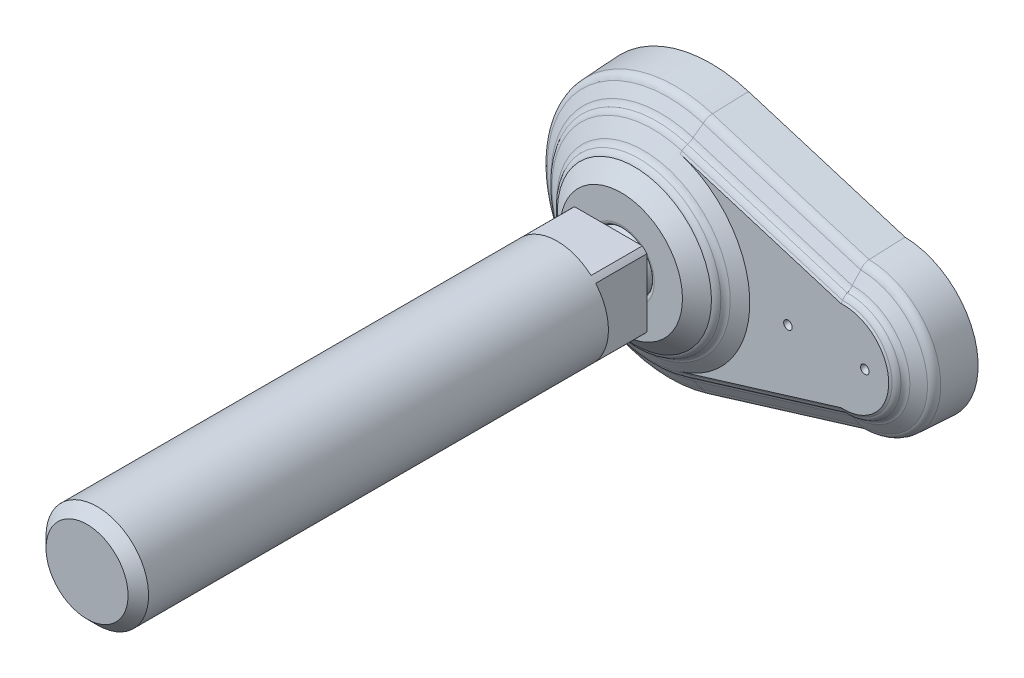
ISO-10303-21;
HEADER;
FILE_DESCRIPTION(('STEP AP214'),'2;1');
FILE_NAME('part.step','',(''),(''),'','','');
FILE_SCHEMA(('AUTOMOTIVE_DESIGN { 1 0 10303 214 1 1 1 1 }'));
ENDSEC;
DATA;
#1=APPLICATION_CONTEXT('core data for automotive mechanical design processes');
#2=APPLICATION_PROTOCOL_DEFINITION('international standard','automotive_design',2000,#1);
#3=PRODUCT_CONTEXT('',#1,'mechanical');
#4=PRODUCT('Part','Part','',(#3));
#5=PRODUCT_RELATED_PRODUCT_CATEGORY('part','',(#4));
#6=PRODUCT_DEFINITION_FORMATION('','',#4);
#7=PRODUCT_DEFINITION_CONTEXT('part definition',#1,'design');
#8=PRODUCT_DEFINITION('design','',#6,#7);
#9=PRODUCT_DEFINITION_SHAPE('','',#8);
#10=(LENGTH_UNIT() NAMED_UNIT(*) SI_UNIT(.MILLI.,.METRE.));
#11=(NAMED_UNIT(*) PLANE_ANGLE_UNIT() SI_UNIT($,.RADIAN.));
#12=(NAMED_UNIT(*) SI_UNIT($,.STERADIAN.) SOLID_ANGLE_UNIT());
#13=UNCERTAINTY_MEASURE_WITH_UNIT(LENGTH_MEASURE(1.E-05),#10,'distance_accuracy_value','');
#14=(GEOMETRIC_REPRESENTATION_CONTEXT(3) GLOBAL_UNCERTAINTY_ASSIGNED_CONTEXT((#13)) GLOBAL_UNIT_ASSIGNED_CONTEXT((#10,
#11,#12)) REPRESENTATION_CONTEXT('',''));
#15=CARTESIAN_POINT('',(0.,0.,0.));
#16=DIRECTION('',(0.,0.,1.));
#17=DIRECTION('',(1.,0.,0.));
#18=AXIS2_PLACEMENT_3D('',#15,#16,#17);
#19=CARTESIAN_POINT('',(0.,0.,38.));
#20=DIRECTION('',(0.,0.,1.));
#21=DIRECTION('',(-1.,0.,0.));
#22=AXIS2_PLACEMENT_3D('',#19,#20,#21);
#23=CYLINDRICAL_SURFACE('',#22,12.);
#24=CARTESIAN_POINT('',(0.,0.,145.6));
#25=DIRECTION('',(0.,0.,1.));
#26=DIRECTION('',(-1.,0.,0.));
#27=AXIS2_PLACEMENT_3D('',#24,#25,#26);
#28=CIRCLE('',#27,12.);
#29=CARTESIAN_POINT('',(-12.,0.,145.6));
#30=VERTEX_POINT('',#29);
#31=EDGE_CURVE('E9',#30,#30,#28,.F.);
#32=ORIENTED_EDGE('',*,*,#31,.T.);
#33=EDGE_LOOP('',(#32));
#34=FACE_BOUND('',#33,.T.);
#35=DIRECTION('',(0.,0.,1.));
#36=VECTOR('',#35,1.);
#37=CARTESIAN_POINT('',(-7.93725393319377,-9.,38.));
#38=LINE('',#37,#36);
#39=CARTESIAN_POINT('',(-7.93725393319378,-9.,38.));
#40=VERTEX_POINT('',#39);
#41=CARTESIAN_POINT('',(-7.93725393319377,-9.,26.));
#42=VERTEX_POINT('',#41);
#43=EDGE_CURVE('E159',#40,#42,#38,.F.);
#44=ORIENTED_EDGE('',*,*,#43,.F.);
#45=CARTESIAN_POINT('',(0.,0.,38.));
#46=DIRECTION('',(0.,0.,1.));
#47=DIRECTION('',(0.,-1.,0.));
#48=AXIS2_PLACEMENT_3D('',#45,#46,#47);
#49=CIRCLE('',#48,12.);
#50=CARTESIAN_POINT('',(7.93725393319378,-9.,38.));
#51=VERTEX_POINT('',#50);
#52=EDGE_CURVE('E1164',#40,#51,#49,.T.);
#53=ORIENTED_EDGE('',*,*,#52,.T.);
#54=DIRECTION('',(0.,0.,1.));
#55=VECTOR('',#54,1.);
#56=CARTESIAN_POINT('',(7.93725393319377,-9.,38.));
#57=LINE('',#56,#55);
#58=CARTESIAN_POINT('',(7.93725393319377,-9.,26.));
#59=VERTEX_POINT('',#58);
#60=EDGE_CURVE('E224',#59,#51,#57,.T.);
#61=ORIENTED_EDGE('',*,*,#60,.F.);
#62=CARTESIAN_POINT('',(0.,0.,26.));
#63=DIRECTION('',(0.,0.,1.));
#64=DIRECTION('',(-1.,0.,0.));
#65=AXIS2_PLACEMENT_3D('',#62,#63,#64);
#66=CIRCLE('',#65,12.);
#67=CARTESIAN_POINT('',(9.,-7.93725393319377,26.));
#68=VERTEX_POINT('',#67);
#69=EDGE_CURVE('E207',#59,#68,#66,.T.);
#70=ORIENTED_EDGE('',*,*,#69,.T.);
#71=DIRECTION('',(0.,0.,1.));
#72=VECTOR('',#71,1.);
#73=CARTESIAN_POINT('',(9.,-7.93725393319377,38.));
#74=LINE('',#73,#72);
#75=CARTESIAN_POINT('',(9.,-7.93725393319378,38.));
#76=VERTEX_POINT('',#75);
#77=EDGE_CURVE('E221',#76,#68,#74,.F.);
#78=ORIENTED_EDGE('',*,*,#77,.F.);
#79=CARTESIAN_POINT('',(9.,7.93725393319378,38.));
#80=VERTEX_POINT('',#79);
#81=EDGE_CURVE('E301',#76,#80,#49,.T.);
#82=ORIENTED_EDGE('',*,*,#81,.T.);
#83=DIRECTION('',(0.,0.,1.));
#84=VECTOR('',#83,1.);
#85=CARTESIAN_POINT('',(9.,7.93725393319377,38.));
#86=LINE('',#85,#84);
#87=CARTESIAN_POINT('',(9.,7.93725393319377,26.));
#88=VERTEX_POINT('',#87);
#89=EDGE_CURVE('E266',#88,#80,#86,.T.);
#90=ORIENTED_EDGE('',*,*,#89,.F.);
#91=CARTESIAN_POINT('',(7.93725393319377,9.,26.));
#92=VERTEX_POINT('',#91);
#93=EDGE_CURVE('E203',#88,#92,#66,.T.);
#94=ORIENTED_EDGE('',*,*,#93,.T.);
#95=DIRECTION('',(0.,0.,1.));
#96=VECTOR('',#95,1.);
#97=CARTESIAN_POINT('',(7.93725393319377,9.,38.));
#98=LINE('',#97,#96);
#99=CARTESIAN_POINT('',(7.93725393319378,9.,38.));
#100=VERTEX_POINT('',#99);
#101=EDGE_CURVE('E184',#100,#92,#98,.F.);
#102=ORIENTED_EDGE('',*,*,#101,.F.);
#103=CARTESIAN_POINT('',(-7.93725393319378,9.,38.));
#104=VERTEX_POINT('',#103);
#105=EDGE_CURVE('E197',#100,#104,#49,.T.);
#106=ORIENTED_EDGE('',*,*,#105,.T.);
#107=DIRECTION('',(0.,0.,1.));
#108=VECTOR('',#107,1.);
#109=CARTESIAN_POINT('',(-7.93725393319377,9.,38.));
#110=LINE('',#109,#108);
#111=CARTESIAN_POINT('',(-7.93725393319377,9.,26.));
#112=VERTEX_POINT('',#111);
#113=EDGE_CURVE('E182',#112,#104,#110,.T.);
#114=ORIENTED_EDGE('',*,*,#113,.F.);
#115=CARTESIAN_POINT('',(-9.,7.93725393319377,26.));
#116=VERTEX_POINT('',#115);
#117=EDGE_CURVE('E195',#112,#116,#66,.T.);
#118=ORIENTED_EDGE('',*,*,#117,.T.);
#119=DIRECTION('',(0.,0.,1.));
#120=VECTOR('',#119,1.);
#121=CARTESIAN_POINT('',(-9.,7.93725393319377,38.));
#122=LINE('',#121,#120);
#123=CARTESIAN_POINT('',(-9.,7.93725393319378,38.));
#124=VERTEX_POINT('',#123);
#125=EDGE_CURVE('E198',#124,#116,#122,.F.);
#126=ORIENTED_EDGE('',*,*,#125,.F.);
#127=CARTESIAN_POINT('',(-9.,-7.93725393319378,38.));
#128=VERTEX_POINT('',#127);
#129=EDGE_CURVE('E1166',#124,#128,#49,.T.);
#130=ORIENTED_EDGE('',*,*,#129,.T.);
#131=DIRECTION('',(0.,0.,1.));
#132=VECTOR('',#131,1.);
#133=CARTESIAN_POINT('',(-9.,-7.93725393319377,38.));
#134=LINE('',#133,#132);
#135=CARTESIAN_POINT('',(-9.,-7.93725393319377,26.));
#136=VERTEX_POINT('',#135);
#137=EDGE_CURVE('E204',#136,#128,#134,.T.);
#138=ORIENTED_EDGE('',*,*,#137,.F.);
#139=EDGE_CURVE('E206',#136,#42,#66,.T.);
#140=ORIENTED_EDGE('',*,*,#139,.T.);
#141=EDGE_LOOP('',(#44,#53,#61,#70,#78,#82,#90,#94,#102,#106,#114,#118,#126,#130,#138,#140));
#142=FACE_BOUND('',#141,.T.);
#143=ADVANCED_FACE('F15',(#34,#142),#23,.T.);
#144=CARTESIAN_POINT('',(-5.24903501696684,0.,26.));
#145=DIRECTION('',(0.,0.,1.));
#146=DIRECTION('',(-1.,0.,0.));
#147=AXIS2_PLACEMENT_3D('',#144,#145,#146);
#148=PLANE('',#147);
#149=DIRECTION('',(0.,-1.,0.));
#150=VECTOR('',#149,1.);
#151=CARTESIAN_POINT('',(-9.,9.,26.));
#152=LINE('',#151,#150);
#153=EDGE_CURVE('E32',#116,#136,#152,.T.);
#154=ORIENTED_EDGE('',*,*,#153,.F.);
#155=ORIENTED_EDGE('',*,*,#117,.F.);
#156=DIRECTION('',(-1.,0.,0.));
#157=VECTOR('',#156,1.);
#158=CARTESIAN_POINT('',(9.,9.,26.));
#159=LINE('',#158,#157);
#160=EDGE_CURVE('E177',#92,#112,#159,.T.);
#161=ORIENTED_EDGE('',*,*,#160,.F.);
#162=ORIENTED_EDGE('',*,*,#93,.F.);
#163=DIRECTION('',(0.,1.,0.));
#164=VECTOR('',#163,1.);
#165=CARTESIAN_POINT('',(9.,-9.,26.));
#166=LINE('',#165,#164);
#167=EDGE_CURVE('E189',#68,#88,#166,.T.);
#168=ORIENTED_EDGE('',*,*,#167,.F.);
#169=ORIENTED_EDGE('',*,*,#69,.F.);
#170=DIRECTION('',(1.,0.,0.));
#171=VECTOR('',#170,1.);
#172=CARTESIAN_POINT('',(-9.,-9.,26.));
#173=LINE('',#172,#171);
#174=EDGE_CURVE('E226',#42,#59,#173,.T.);
#175=ORIENTED_EDGE('',*,*,#174,.F.);
#176=ORIENTED_EDGE('',*,*,#139,.F.);
#177=EDGE_LOOP('',(#154,#155,#161,#162,#168,#169,#175,#176));
#178=FACE_BOUND('',#177,.T.);
#179=CARTESIAN_POINT('',(0.,0.,26.));
#180=DIRECTION('',(0.,0.,1.));
#181=DIRECTION('',(-1.,0.,0.));
#182=AXIS2_PLACEMENT_3D('',#179,#180,#181);
#183=CIRCLE('',#182,5.24903501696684);
#184=CARTESIAN_POINT('',(-5.24903501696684,0.,26.));
#185=VERTEX_POINT('',#184);
#186=EDGE_CURVE('E212',#185,#185,#183,.T.);
#187=ORIENTED_EDGE('',*,*,#186,.T.);
#188=EDGE_LOOP('',(#187));
#189=FACE_BOUND('',#188,.T.);
#190=ADVANCED_FACE('F200',(#178,#189),#148,.F.);
#191=CARTESIAN_POINT('',(0.,0.,19.6309999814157));
#192=DIRECTION('',(0.,0.,1.));
#193=DIRECTION('',(-1.,0.,0.));
#194=AXIS2_PLACEMENT_3D('',#191,#192,#193);
#195=DEGENERATE_TOROIDAL_SURFACE('',#194,0.0005038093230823,6.829,.T.);
#196=CARTESIAN_POINT('',(0.,0.,20.775));
#197=DIRECTION('',(0.,0.,-1.));
#198=DIRECTION('',(1.,0.,0.));
#199=AXIS2_PLACEMENT_3D('',#196,#197,#198);
#200=CIRCLE('',#199,6.733);
#201=CARTESIAN_POINT('',(6.733,0.,20.775));
#202=VERTEX_POINT('',#201);
#203=EDGE_CURVE('E273',#202,#202,#200,.T.);
#204=ORIENTED_EDGE('',*,*,#203,.F.);
#205=EDGE_LOOP('',(#204));
#206=FACE_BOUND('',#205,.T.);
#207=CARTESIAN_POINT('',(0.,0.,24.));
#208=DIRECTION('',(0.,0.,1.));
#209=DIRECTION('',(-1.,0.,0.));
#210=AXIS2_PLACEMENT_3D('',#207,#208,#209);
#211=CIRCLE('',#210,5.24903501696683);
#212=CARTESIAN_POINT('',(-5.24903501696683,0.,24.));
#213=VERTEX_POINT('',#212);
#214=EDGE_CURVE('E214',#213,#213,#211,.T.);
#215=ORIENTED_EDGE('',*,*,#214,.F.);
#216=EDGE_LOOP('',(#215));
#217=FACE_BOUND('',#216,.T.);
#218=ADVANCED_FACE('F533',(#206,#217),#195,.T.);
#219=CARTESIAN_POINT('',(0.,0.,38.));
#220=DIRECTION('',(0.,0.,1.));
#221=DIRECTION('',(-1.,0.,0.));
#222=AXIS2_PLACEMENT_3D('',#219,#220,#221);
#223=CYLINDRICAL_SURFACE('',#222,5.24903501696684);
#224=ORIENTED_EDGE('',*,*,#186,.F.);
#225=EDGE_LOOP('',(#224));
#226=FACE_BOUND('',#225,.T.);
#227=ORIENTED_EDGE('',*,*,#214,.T.);
#228=EDGE_LOOP('',(#227));
#229=FACE_BOUND('',#228,.T.);
#230=ADVANCED_FACE('F1117',(#226,#229),#223,.T.);
#231=CARTESIAN_POINT('',(-9.,-9.,26.));
#232=DIRECTION('',(0.,-1.,0.));
#233=DIRECTION('',(1.,0.,0.));
#234=AXIS2_PLACEMENT_3D('',#231,#232,#233);
#235=PLANE('',#234);
#236=ORIENTED_EDGE('',*,*,#60,.T.);
#237=DIRECTION('',(-1.,0.,0.));
#238=VECTOR('',#237,1.);
#239=CARTESIAN_POINT('',(-12.,-9.,38.));
#240=LINE('',#239,#238);
#241=EDGE_CURVE('E238',#51,#40,#240,.T.);
#242=ORIENTED_EDGE('',*,*,#241,.T.);
#243=ORIENTED_EDGE('',*,*,#43,.T.);
#244=ORIENTED_EDGE('',*,*,#174,.T.);
#245=EDGE_LOOP('',(#236,#242,#243,#244));
#246=FACE_BOUND('',#245,.T.);
#247=ADVANCED_FACE('F1109',(#246),#235,.T.);
#248=CARTESIAN_POINT('',(9.,-9.,26.));
#249=DIRECTION('',(1.,0.,0.));
#250=DIRECTION('',(0.,1.,0.));
#251=AXIS2_PLACEMENT_3D('',#248,#249,#250);
#252=PLANE('',#251);
#253=ORIENTED_EDGE('',*,*,#89,.T.);
#254=DIRECTION('',(0.,-1.,0.));
#255=VECTOR('',#254,1.);
#256=CARTESIAN_POINT('',(9.,0.,38.));
#257=LINE('',#256,#255);
#258=EDGE_CURVE('E245',#80,#76,#257,.T.);
#259=ORIENTED_EDGE('',*,*,#258,.T.);
#260=ORIENTED_EDGE('',*,*,#77,.T.);
#261=ORIENTED_EDGE('',*,*,#167,.T.);
#262=EDGE_LOOP('',(#253,#259,#260,#261));
#263=FACE_BOUND('',#262,.T.);
#264=ADVANCED_FACE('F1101',(#263),#252,.T.);
#265=CARTESIAN_POINT('',(9.,9.,26.));
#266=DIRECTION('',(0.,1.,0.));
#267=DIRECTION('',(-1.,0.,0.));
#268=AXIS2_PLACEMENT_3D('',#265,#266,#267);
#269=PLANE('',#268);
#270=ORIENTED_EDGE('',*,*,#113,.T.);
#271=DIRECTION('',(1.,0.,0.));
#272=VECTOR('',#271,1.);
#273=CARTESIAN_POINT('',(-12.,9.,38.));
#274=LINE('',#273,#272);
#275=EDGE_CURVE('E249',#104,#100,#274,.T.);
#276=ORIENTED_EDGE('',*,*,#275,.T.);
#277=ORIENTED_EDGE('',*,*,#101,.T.);
#278=ORIENTED_EDGE('',*,*,#160,.T.);
#279=EDGE_LOOP('',(#270,#276,#277,#278));
#280=FACE_BOUND('',#279,.T.);
#281=ADVANCED_FACE('F179',(#280),#269,.T.);
#282=CARTESIAN_POINT('',(-9.,9.,26.));
#283=DIRECTION('',(-1.,0.,0.));
#284=DIRECTION('',(0.,-1.,0.));
#285=AXIS2_PLACEMENT_3D('',#282,#283,#284);
#286=PLANE('',#285);
#287=ORIENTED_EDGE('',*,*,#137,.T.);
#288=DIRECTION('',(0.,1.,0.));
#289=VECTOR('',#288,1.);
#290=CARTESIAN_POINT('',(-9.,0.,38.));
#291=LINE('',#290,#289);
#292=EDGE_CURVE('E262',#128,#124,#291,.T.);
#293=ORIENTED_EDGE('',*,*,#292,.T.);
#294=ORIENTED_EDGE('',*,*,#125,.T.);
#295=ORIENTED_EDGE('',*,*,#153,.T.);
#296=EDGE_LOOP('',(#287,#293,#294,#295));
#297=FACE_BOUND('',#296,.T.);
#298=ADVANCED_FACE('F873',(#297),#286,.T.);
#299=CARTESIAN_POINT('',(0.,0.,0.));
#300=DIRECTION('',(0.,0.,1.));
#301=DIRECTION('',(0.,-1.,0.));
#302=AXIS2_PLACEMENT_3D('',#299,#300,#301);
#303=PLANE('',#302);
#304=DIRECTION('',(-0.950373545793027,0.311111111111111,0.));
#305=VECTOR('',#304,1.);
#306=CARTESIAN_POINT('',(48.7333333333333,11.4044825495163,0.));
#307=LINE('',#306,#305);
#308=CARTESIAN_POINT('',(48.7333333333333,11.4044825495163,0.));
#309=VERTEX_POINT('',#308);
#310=CARTESIAN_POINT('',(8.08888888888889,24.7097121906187,0.));
#311=VERTEX_POINT('',#310);
#312=EDGE_CURVE('E285',#309,#311,#307,.T.);
#313=ORIENTED_EDGE('',*,*,#312,.F.);
#314=CARTESIAN_POINT('',(45.,0.,0.));
#315=DIRECTION('',(0.,0.,1.));
#316=DIRECTION('',(1.,0.,0.));
#317=AXIS2_PLACEMENT_3D('',#314,#315,#316);
#318=CIRCLE('',#317,12.);
#319=CARTESIAN_POINT('',(48.7333333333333,-11.4044825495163,0.));
#320=VERTEX_POINT('',#319);
#321=EDGE_CURVE('E295',#320,#309,#318,.T.);
#322=ORIENTED_EDGE('',*,*,#321,.F.);
#323=DIRECTION('',(0.950373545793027,0.311111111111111,0.));
#324=VECTOR('',#323,1.);
#325=CARTESIAN_POINT('',(8.08888888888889,-24.7097121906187,0.));
#326=LINE('',#325,#324);
#327=CARTESIAN_POINT('',(8.08888888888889,-24.7097121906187,0.));
#328=VERTEX_POINT('',#327);
#329=EDGE_CURVE('E292',#328,#320,#326,.T.);
#330=ORIENTED_EDGE('',*,*,#329,.F.);
#331=CARTESIAN_POINT('',(0.,0.,0.));
#332=DIRECTION('',(0.,0.,1.));
#333=DIRECTION('',(1.,0.,0.));
#334=AXIS2_PLACEMENT_3D('',#331,#332,#333);
#335=CIRCLE('',#334,26.);
#336=EDGE_CURVE('E288',#311,#328,#335,.T.);
#337=ORIENTED_EDGE('',*,*,#336,.F.);
#338=EDGE_LOOP('',(#313,#322,#330,#337));
#339=FACE_BOUND('',#338,.T.);
#340=ADVANCED_FACE('F535',(#339),#303,.F.);
#341=CARTESIAN_POINT('',(8.08888888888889,-24.7097121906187,0.));
#342=DIRECTION('',(0.311111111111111,-0.950373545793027,0.));
#343=DIRECTION('',(0.950373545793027,0.311111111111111,0.));
#344=AXIS2_PLACEMENT_3D('',#341,#342,#343);
#345=PLANE('',#344);
#346=DIRECTION('',(0.950373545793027,0.311111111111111,0.));
#347=VECTOR('',#346,1.);
#348=CARTESIAN_POINT('',(8.08888888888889,-24.7097121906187,2.));
#349=LINE('',#348,#347);
#350=CARTESIAN_POINT('',(8.08888888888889,-24.7097121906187,2.));
#351=VERTEX_POINT('',#350);
#352=CARTESIAN_POINT('',(48.7333333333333,-11.4044825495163,2.));
#353=VERTEX_POINT('',#352);
#354=EDGE_CURVE('E304',#351,#353,#349,.T.);
#355=ORIENTED_EDGE('',*,*,#354,.F.);
#356=DIRECTION('',(0.,0.,1.));
#357=VECTOR('',#356,1.);
#358=CARTESIAN_POINT('',(8.08888888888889,-24.7097121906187,0.));
#359=LINE('',#358,#357);
#360=EDGE_CURVE('E312',#328,#351,#359,.T.);
#361=ORIENTED_EDGE('',*,*,#360,.F.);
#362=ORIENTED_EDGE('',*,*,#329,.T.);
#363=DIRECTION('',(0.,0.,1.));
#364=VECTOR('',#363,1.);
#365=CARTESIAN_POINT('',(48.7333333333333,-11.4044825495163,0.));
#366=LINE('',#365,#364);
#367=EDGE_CURVE('E310',#320,#353,#366,.T.);
#368=ORIENTED_EDGE('',*,*,#367,.T.);
#369=EDGE_LOOP('',(#355,#361,#362,#368));
#370=FACE_BOUND('',#369,.T.);
#371=ADVANCED_FACE('F1056',(#370),#345,.T.);
#372=CARTESIAN_POINT('',(0.,0.,0.));
#373=DIRECTION('',(0.,0.,1.));
#374=DIRECTION('',(0.,-1.,0.));
#375=AXIS2_PLACEMENT_3D('',#372,#373,#374);
#376=CYLINDRICAL_SURFACE('',#375,26.);
#377=CARTESIAN_POINT('',(0.,0.,2.));
#378=DIRECTION('',(0.,0.,1.));
#379=DIRECTION('',(1.,0.,0.));
#380=AXIS2_PLACEMENT_3D('',#377,#378,#379);
#381=CIRCLE('',#380,26.);
#382=CARTESIAN_POINT('',(8.08888888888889,24.7097121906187,2.));
#383=VERTEX_POINT('',#382);
#384=EDGE_CURVE('E300',#383,#351,#381,.T.);
#385=ORIENTED_EDGE('',*,*,#384,.F.);
#386=DIRECTION('',(0.,0.,1.));
#387=VECTOR('',#386,1.);
#388=CARTESIAN_POINT('',(8.08888888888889,24.7097121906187,0.));
#389=LINE('',#388,#387);
#390=EDGE_CURVE('E314',#311,#383,#389,.T.);
#391=ORIENTED_EDGE('',*,*,#390,.F.);
#392=ORIENTED_EDGE('',*,*,#336,.T.);
#393=ORIENTED_EDGE('',*,*,#360,.T.);
#394=EDGE_LOOP('',(#385,#391,#392,#393));
#395=FACE_BOUND('',#394,.T.);
#396=ADVANCED_FACE('F1063',(#395),#376,.T.);
#397=CARTESIAN_POINT('',(48.7333333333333,11.4044825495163,0.));
#398=DIRECTION('',(0.311111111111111,0.950373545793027,0.));
#399=DIRECTION('',(-0.950373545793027,0.311111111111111,0.));
#400=AXIS2_PLACEMENT_3D('',#397,#398,#399);
#401=PLANE('',#400);
#402=DIRECTION('',(-0.950373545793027,0.311111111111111,0.));
#403=VECTOR('',#402,1.);
#404=CARTESIAN_POINT('',(48.7333333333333,11.4044825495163,2.));
#405=LINE('',#404,#403);
#406=CARTESIAN_POINT('',(48.7333333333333,11.4044825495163,2.));
#407=VERTEX_POINT('',#406);
#408=EDGE_CURVE('E150',#407,#383,#405,.T.);
#409=ORIENTED_EDGE('',*,*,#408,.F.);
#410=DIRECTION('',(0.,0.,1.));
#411=VECTOR('',#410,1.);
#412=CARTESIAN_POINT('',(48.7333333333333,11.4044825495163,0.));
#413=LINE('',#412,#411);
#414=EDGE_CURVE('E298',#309,#407,#413,.T.);
#415=ORIENTED_EDGE('',*,*,#414,.F.);
#416=ORIENTED_EDGE('',*,*,#312,.T.);
#417=ORIENTED_EDGE('',*,*,#390,.T.);
#418=EDGE_LOOP('',(#409,#415,#416,#417));
#419=FACE_BOUND('',#418,.T.);
#420=ADVANCED_FACE('F557',(#419),#401,.T.);
#421=CARTESIAN_POINT('',(45.,0.,0.));
#422=DIRECTION('',(0.,0.,1.));
#423=DIRECTION('',(0.,-1.,0.));
#424=AXIS2_PLACEMENT_3D('',#421,#422,#423);
#425=CYLINDRICAL_SURFACE('',#424,12.);
#426=CARTESIAN_POINT('',(45.,0.,2.));
#427=DIRECTION('',(0.,0.,1.));
#428=DIRECTION('',(1.,0.,0.));
#429=AXIS2_PLACEMENT_3D('',#426,#427,#428);
#430=CIRCLE('',#429,12.);
#431=EDGE_CURVE('E289',#353,#407,#430,.T.);
#432=ORIENTED_EDGE('',*,*,#431,.F.);
#433=ORIENTED_EDGE('',*,*,#367,.F.);
#434=ORIENTED_EDGE('',*,*,#321,.T.);
#435=ORIENTED_EDGE('',*,*,#414,.T.);
#436=EDGE_LOOP('',(#432,#433,#434,#435));
#437=FACE_BOUND('',#436,.T.);
#438=ADVANCED_FACE('F543',(#437),#425,.T.);
#439=CARTESIAN_POINT('',(45.,0.,2.));
#440=DIRECTION('',(0.,0.,-1.));
#441=DIRECTION('',(0.,1.,0.));
#442=AXIS2_PLACEMENT_3D('',#439,#440,#441);
#443=CONICAL_SURFACE('',#442,17.5,0.0523365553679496);
#444=CARTESIAN_POINT('',(45.,0.,10.304));
#445=DIRECTION('',(0.,0.,1.));
#446=DIRECTION('',(0.,-1.,0.));
#447=AXIS2_PLACEMENT_3D('',#444,#445,#446);
#448=CIRCLE('',#447,17.065);
#449=CARTESIAN_POINT('',(45.3136024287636,-17.0621182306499,10.304));
#450=VERTEX_POINT('',#449);
#451=CARTESIAN_POINT('',(45.3136024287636,17.0621182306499,10.304));
#452=VERTEX_POINT('',#451);
#453=EDGE_CURVE('E363',#450,#452,#448,.T.);
#454=ORIENTED_EDGE('',*,*,#453,.F.);
#455=CARTESIAN_POINT('',(45.3136007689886,-17.0621077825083,10.3042));
#456=CARTESIAN_POINT('',(45.3250873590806,-17.134412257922,8.92013380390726));
#457=CARTESIAN_POINT('',(45.3366049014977,-17.206707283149,7.5360673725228));
#458=CARTESIAN_POINT('',(45.3597018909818,-17.3512784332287,4.76793403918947));
#459=CARTESIAN_POINT('',(45.3712813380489,-17.4235545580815,3.38386713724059));
#460=CARTESIAN_POINT('',(45.3828917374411,-17.4958212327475,1.9998));
#461=B_SPLINE_CURVE_WITH_KNOTS('',3,(#455,#456,#457,#458,#459,#460),.UNSPECIFIED.,.F.,.F.,(4,2,
4),(0.,4.15800336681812,8.31600673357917),.UNSPECIFIED.);
#462=CARTESIAN_POINT('',(45.3828900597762,-17.4958107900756,2.));
#463=VERTEX_POINT('',#462);
#464=EDGE_CURVE('E669',#450,#463,#461,.T.);
#465=ORIENTED_EDGE('',*,*,#464,.T.);
#466=CARTESIAN_POINT('',(45.,0.,2.));
#467=DIRECTION('',(0.,0.,1.));
#468=DIRECTION('',(0.,-1.,0.));
#469=AXIS2_PLACEMENT_3D('',#466,#467,#468);
#470=CIRCLE('',#469,17.5);
#471=CARTESIAN_POINT('',(45.3828900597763,17.4958107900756,2.));
#472=VERTEX_POINT('',#471);
#473=EDGE_CURVE('E366',#463,#472,#470,.T.);
#474=ORIENTED_EDGE('',*,*,#473,.T.);
#475=CARTESIAN_POINT('',(45.3828917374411,17.4958212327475,1.9998));
#476=CARTESIAN_POINT('',(45.371281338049,17.4235545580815,3.38386713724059));
#477=CARTESIAN_POINT('',(45.359701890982,17.3512784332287,4.76793403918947));
#478=CARTESIAN_POINT('',(45.3366049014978,17.206707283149,7.5360673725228));
#479=CARTESIAN_POINT('',(45.3250873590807,17.134412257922,8.92013380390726));
#480=CARTESIAN_POINT('',(45.3136007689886,17.0621077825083,10.3042));
#481=B_SPLINE_CURVE_WITH_KNOTS('',3,(#475,#476,#477,#478,#479,#480),.UNSPECIFIED.,.F.,.F.,(4,2,
4),(0.,4.15800336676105,8.31600673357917),.UNSPECIFIED.);
#482=EDGE_CURVE('E685',#472,#452,#481,.T.);
#483=ORIENTED_EDGE('',*,*,#482,.T.);
#484=EDGE_LOOP('',(#454,#465,#474,#483));
#485=FACE_BOUND('',#484,.T.);
#486=ADVANCED_FACE('F423',(#485),#443,.T.);
#487=CARTESIAN_POINT('',(46.8961596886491,-16.5782819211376,10.304));
#488=DIRECTION('',(-0.291971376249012,0.9549953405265,-0.0523126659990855));
#489=DIRECTION('',(-0.956304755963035,-0.292371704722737,0.));
#490=AXIS2_PLACEMENT_3D('',#487,#488,#489);
#491=PLANE('',#490);
#492=ORIENTED_EDGE('',*,*,#464,.F.);
#493=DIRECTION('',(-0.956304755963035,-0.292371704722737,0.));
#494=VECTOR('',#493,1.);
#495=CARTESIAN_POINT('',(46.8961596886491,-16.5782819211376,10.304));
#496=LINE('',#495,#494);
#497=CARTESIAN_POINT('',(8.64396945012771,-28.2731501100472,10.304));
#498=VERTEX_POINT('',#497);
#499=EDGE_CURVE('E617',#450,#498,#496,.T.);
#500=ORIENTED_EDGE('',*,*,#499,.T.);
#501=DIRECTION('',(-0.0152947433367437,0.050026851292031,0.998630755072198));
#502=VECTOR('',#501,1.);
#503=CARTESIAN_POINT('',(8.7711511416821,-28.689142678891,2.));
#504=LINE('',#503,#502);
#505=CARTESIAN_POINT('',(8.7711511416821,-28.689142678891,2.));
#506=VERTEX_POINT('',#505);
#507=EDGE_CURVE('E623',#506,#498,#504,.T.);
#508=ORIENTED_EDGE('',*,*,#507,.F.);
#509=DIRECTION('',(-0.956304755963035,-0.292371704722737,0.));
#510=VECTOR('',#509,1.);
#511=CARTESIAN_POINT('',(47.0233413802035,-16.9942744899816,2.));
#512=LINE('',#511,#510);
#513=EDGE_CURVE('E144',#463,#506,#512,.T.);
#514=ORIENTED_EDGE('',*,*,#513,.F.);
#515=EDGE_LOOP('',(#492,#500,#508,#514));
#516=FACE_BOUND('',#515,.T.);
#517=ADVANCED_FACE('F529',(#516),#491,.F.);
#518=CARTESIAN_POINT('',(0.,0.,2.));
#519=DIRECTION('',(0.,0.,1.));
#520=DIRECTION('',(0.,-1.,0.));
#521=AXIS2_PLACEMENT_3D('',#518,#519,#520);
#522=PLANE('',#521);
#523=ORIENTED_EDGE('',*,*,#431,.T.);
#524=ORIENTED_EDGE('',*,*,#408,.T.);
#525=ORIENTED_EDGE('',*,*,#384,.T.);
#526=ORIENTED_EDGE('',*,*,#354,.T.);
#527=EDGE_LOOP('',(#523,#524,#525,#526));
#528=FACE_BOUND('',#527,.T.);
#529=DIRECTION('',(-0.956304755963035,0.292371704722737,0.));
#530=VECTOR('',#529,1.);
#531=CARTESIAN_POINT('',(47.0233413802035,16.9942744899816,2.));
#532=LINE('',#531,#530);
#533=CARTESIAN_POINT('',(8.7711511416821,28.689142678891,2.));
#534=VERTEX_POINT('',#533);
#535=EDGE_CURVE('E672',#472,#534,#532,.T.);
#536=ORIENTED_EDGE('',*,*,#535,.F.);
#537=ORIENTED_EDGE('',*,*,#473,.F.);
#538=ORIENTED_EDGE('',*,*,#513,.T.);
#539=CARTESIAN_POINT('',(0.,0.,2.));
#540=DIRECTION('',(0.,0.,1.));
#541=DIRECTION('',(0.,-1.,0.));
#542=AXIS2_PLACEMENT_3D('',#539,#540,#541);
#543=CIRCLE('',#542,30.);
#544=EDGE_CURVE('E412',#534,#506,#543,.T.);
#545=ORIENTED_EDGE('',*,*,#544,.F.);
#546=EDGE_LOOP('',(#536,#537,#538,#545));
#547=FACE_BOUND('',#546,.T.);
#548=ADVANCED_FACE('F421',(#528,#547),#522,.F.);
#549=CARTESIAN_POINT('',(47.0233413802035,16.9942744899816,2.));
#550=DIRECTION('',(-0.291971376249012,-0.9549953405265,-0.0523126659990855));
#551=DIRECTION('',(0.956304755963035,-0.292371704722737,0.));
#552=AXIS2_PLACEMENT_3D('',#549,#550,#551);
#553=PLANE('',#552);
#554=ORIENTED_EDGE('',*,*,#482,.F.);
#555=ORIENTED_EDGE('',*,*,#535,.T.);
#556=DIRECTION('',(-0.0152947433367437,-0.050026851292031,0.998630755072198));
#557=VECTOR('',#556,1.);
#558=CARTESIAN_POINT('',(8.7711511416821,28.689142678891,2.));
#559=LINE('',#558,#557);
#560=CARTESIAN_POINT('',(8.64396945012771,28.2731501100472,10.304));
#561=VERTEX_POINT('',#560);
#562=EDGE_CURVE('E637',#534,#561,#559,.T.);
#563=ORIENTED_EDGE('',*,*,#562,.T.);
#564=DIRECTION('',(-0.956304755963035,0.292371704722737,0.));
#565=VECTOR('',#564,1.);
#566=CARTESIAN_POINT('',(46.8961596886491,16.5782819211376,10.304));
#567=LINE('',#566,#565);
#568=EDGE_CURVE('E673',#452,#561,#567,.T.);
#569=ORIENTED_EDGE('',*,*,#568,.F.);
#570=EDGE_LOOP('',(#554,#555,#563,#569));
#571=FACE_BOUND('',#570,.T.);
#572=ADVANCED_FACE('F499',(#571),#553,.F.);
#573=CARTESIAN_POINT('',(45.,0.,10.2086896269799));
#574=DIRECTION('',(0.,0.,1.));
#575=DIRECTION('',(0.,-1.,0.));
#576=AXIS2_PLACEMENT_3D('',#573,#574,#575);
#577=TOROIDAL_SURFACE('',#576,15.0672723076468,2.);
#578=CARTESIAN_POINT('',(45.313603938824,-17.062127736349,10.3038));
#579=CARTESIAN_POINT('',(45.3131828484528,-17.0594763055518,10.3596419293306));
#580=CARTESIAN_POINT('',(45.3123906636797,-17.0544900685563,10.4153431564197));
#581=CARTESIAN_POINT('',(45.3100724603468,-17.0398916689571,10.5261166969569));
#582=CARTESIAN_POINT('',(45.3085464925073,-17.0302798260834,10.5811890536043));
#583=CARTESIAN_POINT('',(45.3028875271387,-16.9946160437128,10.7447437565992));
#584=CARTESIAN_POINT('',(45.2976717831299,-16.9617253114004,10.8517806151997));
#585=CARTESIAN_POINT('',(45.284530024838,-16.8786837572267,11.0587251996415));
#586=CARTESIAN_POINT('',(45.2766032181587,-16.8285278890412,11.1586308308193));
#587=CARTESIAN_POINT('',(45.2583029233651,-16.7124179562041,11.348570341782));
#588=CARTESIAN_POINT('',(45.24792931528,-16.6464631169,11.4386037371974));
#589=CARTESIAN_POINT('',(45.2250216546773,-16.5003240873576,11.6067133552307));
#590=CARTESIAN_POINT('',(45.2124772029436,-16.4200713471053,11.684728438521));
#591=CARTESIAN_POINT('',(45.1856662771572,-16.2478592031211,11.8261370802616));
#592=CARTESIAN_POINT('',(45.1714009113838,-16.1559073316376,11.8895399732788));
#593=CARTESIAN_POINT('',(45.148748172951,-16.0092275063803,11.9735680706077));
#594=CARTESIAN_POINT('',(45.1408156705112,-15.957749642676,12.0001426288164));
#595=CARTESIAN_POINT('',(45.1246863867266,-15.8528232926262,12.0486569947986));
#596=CARTESIAN_POINT('',(45.1164901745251,-15.7993790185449,12.0706061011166));
#597=CARTESIAN_POINT('',(45.1081834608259,-15.7450737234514,12.0902));
#598=B_SPLINE_CURVE_WITH_KNOTS('',3,(#578,#579,#580,#581,#582,#583,#584,#585,#586,#587,#588,
#589,#590,#591,#592,#593,#594,#595,#596,#597),.UNSPECIFIED.,.F.,.F.,(4,2,2,2,2,2,2,2,2,4),(0.,
0.167615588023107,0.335219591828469,0.669784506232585,1.00444729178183,1.33912648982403,
1.67545571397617,2.01156948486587,2.1867983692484,2.36167155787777),.UNSPECIFIED.);
#599=CARTESIAN_POINT('',(45.108268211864,-15.7456277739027,12.09));
#600=VERTEX_POINT('',#599);
#601=EDGE_CURVE('E691',#450,#600,#598,.T.);
#602=ORIENTED_EDGE('',*,*,#601,.F.);
#603=ORIENTED_EDGE('',*,*,#453,.T.);
#604=CARTESIAN_POINT('',(45.1081834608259,15.7450737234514,12.0902));
#605=CARTESIAN_POINT('',(45.1162755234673,15.7979756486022,12.0711117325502));
#606=CARTESIAN_POINT('',(45.1242625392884,15.8500594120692,12.0497900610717));
#607=CARTESIAN_POINT('',(45.1399729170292,15.9522733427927,12.0028085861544));
#608=CARTESIAN_POINT('',(45.1476962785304,16.0024035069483,11.9771487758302));
#609=CARTESIAN_POINT('',(45.170371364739,16.1492634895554,11.8939254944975));
#610=CARTESIAN_POINT('',(45.1848488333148,16.2425982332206,11.8300692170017));
#611=CARTESIAN_POINT('',(45.2120467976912,16.4173167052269,11.6873614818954));
#612=CARTESIAN_POINT('',(45.2247661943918,16.4986929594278,11.6085007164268));
#613=CARTESIAN_POINT('',(45.2480269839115,16.647087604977,11.4379734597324));
#614=CARTESIAN_POINT('',(45.2585686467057,16.7141077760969,11.3463085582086));
#615=CARTESIAN_POINT('',(45.2770522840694,16.8313730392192,11.1534556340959));
#616=CARTESIAN_POINT('',(45.2850114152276,16.8817288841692,11.0523364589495));
#617=CARTESIAN_POINT('',(45.298151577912,16.9647535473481,10.8429463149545));
#618=CARTESIAN_POINT('',(45.3033350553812,16.9974379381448,10.7346817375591));
#619=CARTESIAN_POINT('',(45.3088197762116,17.0320013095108,10.5716792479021));
#620=CARTESIAN_POINT('',(45.3102579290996,17.0410597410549,10.5184099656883));
#621=CARTESIAN_POINT('',(45.3124461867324,17.0548396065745,10.411403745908));
#622=CARTESIAN_POINT('',(45.3131976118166,17.0595693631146,10.3576679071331));
#623=CARTESIAN_POINT('',(45.313603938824,17.062127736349,10.3038));
#624=B_SPLINE_CURVE_WITH_KNOTS('',3,(#604,#605,#606,#607,#608,#609,#610,#611,#612,#613,#614,
#615,#616,#617,#618,#619,#620,#621,#622,#623),.UNSPECIFIED.,.F.,.F.,(4,2,2,2,2,2,2,2,2,4),(0.,
0.170355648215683,0.340711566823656,0.680992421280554,1.02148505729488,1.36193545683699,
1.70007548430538,2.03791704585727,2.19992239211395,2.36161559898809),.UNSPECIFIED.);
#625=CARTESIAN_POINT('',(45.1082682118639,15.7456277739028,12.09));
#626=VERTEX_POINT('',#625);
#627=EDGE_CURVE('E488',#626,#452,#624,.T.);
#628=ORIENTED_EDGE('',*,*,#627,.F.);
#629=CARTESIAN_POINT('',(45.,0.,12.09));
#630=DIRECTION('',(0.,0.,1.));
#631=DIRECTION('',(0.,-1.,0.));
#632=AXIS2_PLACEMENT_3D('',#629,#630,#631);
#633=CIRCLE('',#632,15.746);
#634=EDGE_CURVE('E360',#600,#626,#633,.T.);
#635=ORIENTED_EDGE('',*,*,#634,.F.);
#636=EDGE_LOOP('',(#602,#603,#628,#635));
#637=FACE_BOUND('',#636,.T.);
#638=ADVANCED_FACE('F472',(#637),#577,.T.);
#639=CARTESIAN_POINT('',(46.312080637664,-14.6678454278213,10.2086896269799));
#640=DIRECTION('',(-0.956304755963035,-0.292371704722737,0.));
#641=DIRECTION('',(0.292371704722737,-0.956304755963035,0.));
#642=AXIS2_PLACEMENT_3D('',#639,#640,#641);
#643=CYLINDRICAL_SURFACE('',#642,2.);
#644=ORIENTED_EDGE('',*,*,#499,.F.);
#645=ORIENTED_EDGE('',*,*,#601,.T.);
#646=DIRECTION('',(-0.956304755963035,-0.292371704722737,0.));
#647=VECTOR('',#646,1.);
#648=CARTESIAN_POINT('',(46.5105214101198,-15.3169159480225,12.09));
#649=LINE('',#648,#647);
#650=CARTESIAN_POINT('',(8.25833117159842,-27.0117841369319,12.09));
#651=VERTEX_POINT('',#650);
#652=EDGE_CURVE('E614',#600,#651,#649,.T.);
#653=ORIENTED_EDGE('',*,*,#652,.T.);
#654=CARTESIAN_POINT('',(8.05989039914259,-26.3627136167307,10.2086896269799));
#655=DIRECTION('',(0.956304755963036,0.292371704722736,0.));
#656=DIRECTION('',(-0.292371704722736,0.956304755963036,0.));
#657=AXIS2_PLACEMENT_3D('',#654,#655,#656);
#658=CIRCLE('',#657,2.);
#659=EDGE_CURVE('E626',#651,#498,#658,.T.);
#660=ORIENTED_EDGE('',*,*,#659,.T.);
#661=EDGE_LOOP('',(#644,#645,#653,#660));
#662=FACE_BOUND('',#661,.T.);
#663=ADVANCED_FACE('F500',(#662),#643,.T.);
#664=CARTESIAN_POINT('',(0.,0.,2.));
#665=DIRECTION('',(0.,0.,-1.));
#666=DIRECTION('',(0.,1.,0.));
#667=AXIS2_PLACEMENT_3D('',#664,#665,#666);
#668=CONICAL_SURFACE('',#667,30.,0.0523365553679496);
#669=CARTESIAN_POINT('',(0.,0.,10.304));
#670=DIRECTION('',(0.,0.,1.));
#671=DIRECTION('',(0.,-1.,0.));
#672=AXIS2_PLACEMENT_3D('',#669,#670,#671);
#673=CIRCLE('',#672,29.565);
#674=EDGE_CURVE('E657',#561,#498,#673,.T.);
#675=ORIENTED_EDGE('',*,*,#674,.F.);
#676=ORIENTED_EDGE('',*,*,#562,.F.);
#677=ORIENTED_EDGE('',*,*,#544,.T.);
#678=ORIENTED_EDGE('',*,*,#507,.T.);
#679=EDGE_LOOP('',(#675,#676,#677,#678));
#680=FACE_BOUND('',#679,.T.);
#681=ADVANCED_FACE('F520',(#680),#668,.T.);
#682=CARTESIAN_POINT('',(46.312080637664,14.6678454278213,10.2086896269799));
#683=DIRECTION('',(-0.956304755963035,0.292371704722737,0.));
#684=DIRECTION('',(-0.292371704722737,-0.956304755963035,0.));
#685=AXIS2_PLACEMENT_3D('',#682,#683,#684);
#686=CYLINDRICAL_SURFACE('',#685,2.);
#687=DIRECTION('',(-0.956304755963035,0.292371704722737,0.));
#688=VECTOR('',#687,1.);
#689=CARTESIAN_POINT('',(46.5105214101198,15.3169159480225,12.09));
#690=LINE('',#689,#688);
#691=CARTESIAN_POINT('',(8.25833117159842,27.0117841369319,12.09));
#692=VERTEX_POINT('',#691);
#693=EDGE_CURVE('E603',#626,#692,#690,.T.);
#694=ORIENTED_EDGE('',*,*,#693,.F.);
#695=ORIENTED_EDGE('',*,*,#627,.T.);
#696=ORIENTED_EDGE('',*,*,#568,.T.);
#697=CARTESIAN_POINT('',(8.05989039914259,26.3627136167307,10.2086896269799));
#698=DIRECTION('',(-0.956304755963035,0.292371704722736,0.));
#699=DIRECTION('',(-0.292371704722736,-0.956304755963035,0.));
#700=AXIS2_PLACEMENT_3D('',#697,#698,#699);
#701=CIRCLE('',#700,2.);
#702=EDGE_CURVE('E640',#692,#561,#701,.T.);
#703=ORIENTED_EDGE('',*,*,#702,.F.);
#704=EDGE_LOOP('',(#694,#695,#696,#703));
#705=FACE_BOUND('',#704,.T.);
#706=ADVANCED_FACE('F431',(#705),#686,.T.);
#707=CARTESIAN_POINT('',(45.,0.,12.09));
#708=DIRECTION('',(0.,0.,-1.));
#709=DIRECTION('',(0.,1.,0.));
#710=AXIS2_PLACEMENT_3D('',#707,#708,#709);
#711=CONICAL_SURFACE('',#710,15.746,0.993858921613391);
#712=CARTESIAN_POINT('',(45.,0.,13.7170000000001));
#713=DIRECTION('',(0.,0.,1.));
#714=DIRECTION('',(0.,-1.,0.));
#715=AXIS2_PLACEMENT_3D('',#712,#713,#714);
#716=CIRCLE('',#715,13.2459999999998);
#717=CARTESIAN_POINT('',(44.7416637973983,-13.243480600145,13.7170000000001));
#718=VERTEX_POINT('',#717);
#719=CARTESIAN_POINT('',(44.7416637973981,13.2434806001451,13.7170000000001));
#720=VERTEX_POINT('',#719);
#721=EDGE_CURVE('E358',#718,#720,#716,.T.);
#722=ORIENTED_EDGE('',*,*,#721,.F.);
#723=CARTESIAN_POINT('',(44.7416208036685,-13.2431723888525,13.7172000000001));
#724=CARTESIAN_POINT('',(44.8000092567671,-13.66082442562,13.4461588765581));
#725=CARTESIAN_POINT('',(44.8597613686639,-14.078214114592,13.1750215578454));
#726=CARTESIAN_POINT('',(44.9819928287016,-14.9124682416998,12.6325548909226));
#727=CARTESIAN_POINT('',(45.0444721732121,-15.3293326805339,12.3612255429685));
#728=CARTESIAN_POINT('',(45.1083151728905,-15.745934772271,12.0898));
#729=B_SPLINE_CURVE_WITH_KNOTS('',3,(#723,#724,#725,#726,#727,#728),.UNSPECIFIED.,.F.,.F.,(4,2,
4),(0.,1.50389468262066,3.0077873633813),.UNSPECIFIED.);
#730=EDGE_CURVE('E481',#718,#600,#729,.T.);
#731=ORIENTED_EDGE('',*,*,#730,.T.);
#732=ORIENTED_EDGE('',*,*,#634,.T.);
#733=CARTESIAN_POINT('',(45.1083151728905,15.745934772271,12.0898));
#734=CARTESIAN_POINT('',(45.0444721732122,15.3293326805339,12.3612255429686));
#735=CARTESIAN_POINT('',(44.9819928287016,14.9124682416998,12.6325548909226));
#736=CARTESIAN_POINT('',(44.8597613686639,14.078214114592,13.1750215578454));
#737=CARTESIAN_POINT('',(44.8000092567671,13.66082442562,13.4461588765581));
#738=CARTESIAN_POINT('',(44.7416208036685,13.2431723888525,13.7172000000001));
#739=B_SPLINE_CURVE_WITH_KNOTS('',3,(#733,#734,#735,#736,#737,#738),.UNSPECIFIED.,.F.,.F.,(4,2,
4),(0.,1.50389268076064,3.0077873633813),.UNSPECIFIED.);
#740=EDGE_CURVE('E475',#626,#720,#739,.T.);
#741=ORIENTED_EDGE('',*,*,#740,.T.);
#742=EDGE_LOOP('',(#722,#731,#732,#741));
#743=FACE_BOUND('',#742,.T.);
#744=ADVANCED_FACE('F466',(#743),#711,.T.);
#745=CARTESIAN_POINT('',(45.7795921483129,-12.9261540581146,13.7170000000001));
#746=DIRECTION('',(-0.159476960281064,0.521625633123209,-0.838137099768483));
#747=DIRECTION('',(0.,0.849002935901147,0.528388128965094));
#748=AXIS2_PLACEMENT_3D('',#745,#746,#747);
#749=PLANE('',#748);
#750=ORIENTED_EDGE('',*,*,#730,.F.);
#751=DIRECTION('',(-0.956304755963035,-0.292371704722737,0.));
#752=VECTOR('',#751,1.);
#753=CARTESIAN_POINT('',(45.7795921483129,-12.9261540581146,13.7170000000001));
#754=LINE('',#753,#752);
#755=CARTESIAN_POINT('',(7.52740190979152,-24.6210222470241,13.7170000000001));
#756=VERTEX_POINT('',#755);
#757=EDGE_CURVE('E609',#718,#756,#754,.T.);
#758=ORIENTED_EDGE('',*,*,#757,.T.);
#759=DIRECTION('',(-0.245047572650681,0.801514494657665,0.545459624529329));
#760=VECTOR('',#759,1.);
#761=CARTESIAN_POINT('',(8.25833117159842,-27.0117841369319,12.09));
#762=LINE('',#761,#760);
#763=EDGE_CURVE('E629',#651,#756,#762,.T.);
#764=ORIENTED_EDGE('',*,*,#763,.F.);
#765=ORIENTED_EDGE('',*,*,#652,.F.);
#766=EDGE_LOOP('',(#750,#758,#764,#765));
#767=FACE_BOUND('',#766,.T.);
#768=ADVANCED_FACE('F470',(#767),#749,.F.);
#769=CARTESIAN_POINT('',(0.,0.,10.2086896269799));
#770=DIRECTION('',(0.,0.,1.));
#771=DIRECTION('',(0.,-1.,0.));
#772=AXIS2_PLACEMENT_3D('',#769,#770,#771);
#773=TOROIDAL_SURFACE('',#772,27.5672723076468,2.);
#774=CARTESIAN_POINT('',(0.,0.,12.09));
#775=DIRECTION('',(0.,0.,1.));
#776=DIRECTION('',(0.,-1.,0.));
#777=AXIS2_PLACEMENT_3D('',#774,#775,#776);
#778=CIRCLE('',#777,28.246);
#779=EDGE_CURVE('E655',#692,#651,#778,.T.);
#780=ORIENTED_EDGE('',*,*,#779,.F.);
#781=ORIENTED_EDGE('',*,*,#702,.T.);
#782=ORIENTED_EDGE('',*,*,#674,.T.);
#783=ORIENTED_EDGE('',*,*,#659,.F.);
#784=EDGE_LOOP('',(#780,#781,#782,#783));
#785=FACE_BOUND('',#784,.T.);
#786=ADVANCED_FACE('F497',(#785),#773,.T.);
#787=CARTESIAN_POINT('',(46.5105214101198,15.3169159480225,12.09));
#788=DIRECTION('',(-0.159476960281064,-0.521625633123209,-0.838137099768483));
#789=DIRECTION('',(0.,0.849002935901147,-0.528388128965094));
#790=AXIS2_PLACEMENT_3D('',#787,#788,#789);
#791=PLANE('',#790);
#792=ORIENTED_EDGE('',*,*,#740,.F.);
#793=ORIENTED_EDGE('',*,*,#693,.T.);
#794=DIRECTION('',(-0.245047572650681,-0.801514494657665,0.545459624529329));
#795=VECTOR('',#794,1.);
#796=CARTESIAN_POINT('',(8.25833117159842,27.0117841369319,12.09));
#797=LINE('',#796,#795);
#798=CARTESIAN_POINT('',(7.52740190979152,24.6210222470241,13.7170000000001));
#799=VERTEX_POINT('',#798);
#800=EDGE_CURVE('E602',#692,#799,#797,.T.);
#801=ORIENTED_EDGE('',*,*,#800,.T.);
#802=DIRECTION('',(-0.956304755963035,0.292371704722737,0.));
#803=VECTOR('',#802,1.);
#804=CARTESIAN_POINT('',(45.7795921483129,12.9261540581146,13.7170000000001));
#805=LINE('',#804,#803);
#806=EDGE_CURVE('E595',#720,#799,#805,.T.);
#807=ORIENTED_EDGE('',*,*,#806,.F.);
#808=EDGE_LOOP('',(#792,#793,#801,#807));
#809=FACE_BOUND('',#808,.T.);
#810=ADVANCED_FACE('F437',(#809),#791,.F.);
#811=CARTESIAN_POINT('',(45.,0.,15.5975547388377));
#812=DIRECTION('',(0.,0.,1.));
#813=DIRECTION('',(0.,-1.,0.));
#814=AXIS2_PLACEMENT_3D('',#811,#812,#813);
#815=TOROIDAL_SURFACE('',#814,13.9471154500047,2.007);
#816=CARTESIAN_POINT('',(44.7417388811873,-13.2440188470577,13.7168000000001));
#817=CARTESIAN_POINT('',(44.7343279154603,-13.1908941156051,13.7365326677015));
#818=CARTESIAN_POINT('',(44.7270601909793,-13.1386083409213,13.7584983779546));
#819=CARTESIAN_POINT('',(44.7128498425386,-13.0360296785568,13.8067671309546));
#820=CARTESIAN_POINT('',(44.7059072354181,-12.9857368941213,13.8330703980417));
#821=CARTESIAN_POINT('',(44.6856140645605,-12.8382408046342,13.9183407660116));
#822=CARTESIAN_POINT('',(44.6728115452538,-12.7445159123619,13.9836326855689));
#823=CARTESIAN_POINT('',(44.6490134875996,-12.5692567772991,14.129233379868));
#824=CARTESIAN_POINT('',(44.6380196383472,-12.487733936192,14.2095560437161));
#825=CARTESIAN_POINT('',(44.6181322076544,-12.3395119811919,14.3828602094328));
#826=CARTESIAN_POINT('',(44.6092328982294,-12.2727724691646,14.4758060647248));
#827=CARTESIAN_POINT('',(44.5998238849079,-12.2019312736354,14.5946409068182));
#828=CARTESIAN_POINT('',(44.5982145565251,-12.1898023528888,14.6158623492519));
#829=CARTESIAN_POINT('',(44.5951037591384,-12.166336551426,14.6587196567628));
#830=CARTESIAN_POINT('',(44.5936021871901,-12.1549989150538,14.6803551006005));
#831=CARTESIAN_POINT('',(44.5921537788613,-12.1440536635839,14.7021999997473));
#832=B_SPLINE_CURVE_WITH_KNOTS('',3,(#816,#817,#818,#819,#820,#821,#822,#823,#824,#825,#826,
#827,#828,#829,#830,#831),.UNSPECIFIED.,.F.,.F.,(4,2,2,2,2,2,2,4),(0.,0.171355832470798,
0.34272053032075,0.685756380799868,1.02911079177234,1.37151502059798,1.44499468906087,
1.51840319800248),.UNSPECIFIED.);
#833=CARTESIAN_POINT('',(44.5921670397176,-12.1441538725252,14.7019999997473));
#834=VERTEX_POINT('',#833);
#835=EDGE_CURVE('E448',#718,#834,#832,.T.);
#836=ORIENTED_EDGE('',*,*,#835,.F.);
#837=ORIENTED_EDGE('',*,*,#721,.T.);
#838=CARTESIAN_POINT('',(44.5921537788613,12.1440536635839,14.7021999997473));
#839=CARTESIAN_POINT('',(44.5955092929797,12.1694097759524,14.6515877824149));
#840=CARTESIAN_POINT('',(44.599152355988,12.1968896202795,14.602091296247));
#841=CARTESIAN_POINT('',(44.6069951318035,12.2559024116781,14.5056278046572));
#842=CARTESIAN_POINT('',(44.6111948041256,12.2874350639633,14.4586606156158));
#843=CARTESIAN_POINT('',(44.6245996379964,12.3878100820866,14.3220118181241));
#844=CARTESIAN_POINT('',(44.6346123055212,12.4624423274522,14.2365574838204));
#845=CARTESIAN_POINT('',(44.6565336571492,12.6247734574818,14.0794943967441));
#846=CARTESIAN_POINT('',(44.6684429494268,12.712476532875,14.0078901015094));
#847=CARTESIAN_POINT('',(44.6938576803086,12.8983236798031,13.8805096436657));
#848=CARTESIAN_POINT('',(44.7073595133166,12.9964441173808,13.8246986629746));
#849=CARTESIAN_POINT('',(44.7247880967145,13.122192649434,13.7664352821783));
#850=CARTESIAN_POINT('',(44.728135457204,13.1463053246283,13.7558334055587));
#851=CARTESIAN_POINT('',(44.7348911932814,13.1948908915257,13.7355957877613));
#852=CARTESIAN_POINT('',(44.7382994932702,13.2193633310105,13.7259589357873));
#853=CARTESIAN_POINT('',(44.7417388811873,13.2440188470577,13.7168000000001));
#854=B_SPLINE_CURVE_WITH_KNOTS('',3,(#838,#839,#840,#841,#842,#843,#844,#845,#846,#847,#848,
#849,#850,#851,#852,#853),.UNSPECIFIED.,.F.,.F.,(4,2,2,2,2,2,2,4),(0.,0.170014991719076,
0.340017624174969,0.679938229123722,1.01996805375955,1.35924229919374,1.43888856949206,
1.51844208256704),.UNSPECIFIED.);
#855=CARTESIAN_POINT('',(44.5921670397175,12.1441538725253,14.7019999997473));
#856=VERTEX_POINT('',#855);
#857=EDGE_CURVE('E441',#856,#720,#854,.T.);
#858=ORIENTED_EDGE('',*,*,#857,.F.);
#859=CARTESIAN_POINT('',(45.,0.,14.7019999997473));
#860=DIRECTION('',(0.,0.,1.));
#861=DIRECTION('',(0.,-1.,0.));
#862=AXIS2_PLACEMENT_3D('',#859,#860,#861);
#863=CIRCLE('',#862,12.1510000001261);
#864=EDGE_CURVE('E356',#834,#856,#863,.T.);
#865=ORIENTED_EDGE('',*,*,#864,.F.);
#866=EDGE_LOOP('',(#836,#837,#858,#865));
#867=FACE_BOUND('',#866,.T.);
#868=ADVANCED_FACE('F460',(#867),#815,.F.);
#869=CARTESIAN_POINT('',(45.9845784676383,-13.5966340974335,15.5975547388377));
#870=DIRECTION('',(-0.956304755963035,-0.292371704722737,0.));
#871=DIRECTION('',(0.292371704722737,-0.956304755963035,0.));
#872=AXIS2_PLACEMENT_3D('',#869,#870,#871);
#873=CYLINDRICAL_SURFACE('',#872,2.007);
#874=ORIENTED_EDGE('',*,*,#757,.F.);
#875=ORIENTED_EDGE('',*,*,#835,.T.);
#876=DIRECTION('',(-0.956304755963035,-0.292371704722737,0.));
#877=VECTOR('',#876,1.);
#878=CARTESIAN_POINT('',(45.4594451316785,-11.8790003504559,14.7019999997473));
#879=LINE('',#878,#877);
#880=CARTESIAN_POINT('',(7.20725489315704,-23.5738685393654,14.7019999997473));
#881=VERTEX_POINT('',#880);
#882=EDGE_CURVE('E589',#834,#881,#879,.T.);
#883=ORIENTED_EDGE('',*,*,#882,.T.);
#884=CARTESIAN_POINT('',(7.7323882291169,-25.291502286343,15.5975547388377));
#885=DIRECTION('',(0.956304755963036,0.292371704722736,0.));
#886=DIRECTION('',(-0.292371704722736,0.956304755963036,0.));
#887=AXIS2_PLACEMENT_3D('',#884,#885,#886);
#888=CIRCLE('',#887,2.007);
#889=EDGE_CURVE('E611',#756,#881,#888,.T.);
#890=ORIENTED_EDGE('',*,*,#889,.F.);
#891=EDGE_LOOP('',(#874,#875,#883,#890));
#892=FACE_BOUND('',#891,.T.);
#893=ADVANCED_FACE('F464',(#892),#873,.F.);
#894=CARTESIAN_POINT('',(0.,0.,12.09));
#895=DIRECTION('',(0.,0.,-1.));
#896=DIRECTION('',(0.,1.,0.));
#897=AXIS2_PLACEMENT_3D('',#894,#895,#896);
#898=CONICAL_SURFACE('',#897,28.246,0.993858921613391);
#899=CARTESIAN_POINT('',(0.,0.,13.7170000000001));
#900=DIRECTION('',(0.,0.,1.));
#901=DIRECTION('',(0.,-1.,0.));
#902=AXIS2_PLACEMENT_3D('',#899,#900,#901);
#903=CIRCLE('',#902,25.746);
#904=EDGE_CURVE('E653',#799,#756,#903,.T.);
#905=ORIENTED_EDGE('',*,*,#904,.F.);
#906=ORIENTED_EDGE('',*,*,#800,.F.);
#907=ORIENTED_EDGE('',*,*,#779,.T.);
#908=ORIENTED_EDGE('',*,*,#763,.T.);
#909=EDGE_LOOP('',(#905,#906,#907,#908));
#910=FACE_BOUND('',#909,.T.);
#911=ADVANCED_FACE('F435',(#910),#898,.T.);
#912=CARTESIAN_POINT('',(45.9845784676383,13.5966340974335,15.5975547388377));
#913=DIRECTION('',(-0.956304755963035,0.292371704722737,0.));
#914=DIRECTION('',(-0.292371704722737,-0.956304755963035,0.));
#915=AXIS2_PLACEMENT_3D('',#912,#913,#914);
#916=CYLINDRICAL_SURFACE('',#915,2.007);
#917=DIRECTION('',(-0.956304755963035,0.292371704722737,0.));
#918=VECTOR('',#917,1.);
#919=CARTESIAN_POINT('',(45.4594451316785,11.8790003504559,14.7019999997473));
#920=LINE('',#919,#918);
#921=CARTESIAN_POINT('',(7.20725489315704,23.5738685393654,14.7019999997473));
#922=VERTEX_POINT('',#921);
#923=EDGE_CURVE('E583',#856,#922,#920,.T.);
#924=ORIENTED_EDGE('',*,*,#923,.F.);
#925=ORIENTED_EDGE('',*,*,#857,.T.);
#926=ORIENTED_EDGE('',*,*,#806,.T.);
#927=CARTESIAN_POINT('',(7.7323882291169,25.291502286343,15.5975547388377));
#928=DIRECTION('',(-0.956304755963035,0.292371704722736,0.));
#929=DIRECTION('',(-0.292371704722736,-0.956304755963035,0.));
#930=AXIS2_PLACEMENT_3D('',#927,#928,#929);
#931=CIRCLE('',#930,2.007);
#932=EDGE_CURVE('E644',#799,#922,#931,.T.);
#933=ORIENTED_EDGE('',*,*,#932,.T.);
#934=EDGE_LOOP('',(#924,#925,#926,#933));
#935=FACE_BOUND('',#934,.T.);
#936=ADVANCED_FACE('F422',(#935),#916,.F.);
#937=CARTESIAN_POINT('',(45.,0.,13.8059878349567));
#938=DIRECTION('',(0.,0.,1.));
#939=DIRECTION('',(0.,-1.,0.));
#940=AXIS2_PLACEMENT_3D('',#937,#938,#939);
#941=TOROIDAL_SURFACE('',#940,10.3551126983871,2.007);
#942=CARTESIAN_POINT('',(44.5921803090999,-12.1442541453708,14.7017999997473));
#943=CARTESIAN_POINT('',(44.5888264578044,-12.1189091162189,14.7523579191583));
#944=CARTESIAN_POINT('',(44.5851980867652,-12.0914410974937,14.8018007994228));
#945=CARTESIAN_POINT('',(44.5774254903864,-12.0324505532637,14.8981580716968));
#946=CARTESIAN_POINT('',(44.5732813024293,-12.0009283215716,14.9450726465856));
#947=CARTESIAN_POINT('',(44.5601271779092,-11.900585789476,15.0815540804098));
#948=CARTESIAN_POINT('',(44.5503931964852,-11.8259709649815,15.166895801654));
#949=CARTESIAN_POINT('',(44.5293734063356,-11.6636453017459,15.3237420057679));
#950=CARTESIAN_POINT('',(44.5180870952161,-11.5759302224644,15.3952419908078));
#951=CARTESIAN_POINT('',(44.4943743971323,-11.3900195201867,15.5224423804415));
#952=CARTESIAN_POINT('',(44.4819505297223,-11.2918469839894,15.5781766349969));
#953=CARTESIAN_POINT('',(44.4661159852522,-11.1654767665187,15.6366284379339));
#954=CARTESIAN_POINT('',(44.4630317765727,-11.1408064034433,15.6474450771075));
#955=CARTESIAN_POINT('',(44.4568308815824,-11.0910877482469,15.668072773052));
#956=CARTESIAN_POINT('',(44.4537142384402,-11.0660399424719,15.6778850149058));
#957=CARTESIAN_POINT('',(44.4505813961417,-11.0408004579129,15.6872));
#958=B_SPLINE_CURVE_WITH_KNOTS('',3,(#942,#943,#944,#945,#946,#947,#948,#949,#950,#951,#952,
#953,#954,#955,#956,#957),.UNSPECIFIED.,.F.,.F.,(4,2,2,2,2,2,2,4),(0.,0.169854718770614,
0.339697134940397,0.679258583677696,1.01893018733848,1.35786686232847,1.43919562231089,
1.52042728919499),.UNSPECIFIED.);
#959=CARTESIAN_POINT('',(44.4506486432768,-11.0413422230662,15.687));
#960=VERTEX_POINT('',#959);
#961=EDGE_CURVE('E449',#834,#960,#958,.T.);
#962=ORIENTED_EDGE('',*,*,#961,.F.);
#963=ORIENTED_EDGE('',*,*,#864,.T.);
#964=CARTESIAN_POINT('',(44.4505813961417,11.0408004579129,15.6872));
#965=CARTESIAN_POINT('',(44.4571923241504,11.0940621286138,15.6675450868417));
#966=CARTESIAN_POINT('',(44.4637328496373,11.1464811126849,15.64566148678));
#967=CARTESIAN_POINT('',(44.4766250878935,11.2493192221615,15.5975597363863));
#968=CARTESIAN_POINT('',(44.4829767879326,11.2997382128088,15.5713412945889));
#969=CARTESIAN_POINT('',(44.5016867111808,11.4476029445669,15.4863205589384));
#970=CARTESIAN_POINT('',(44.5136874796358,11.5415577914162,15.421189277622));
#971=CARTESIAN_POINT('',(44.5362881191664,11.7172436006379,15.2758674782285));
#972=CARTESIAN_POINT('',(44.5468865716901,11.798962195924,15.1956619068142));
#973=CARTESIAN_POINT('',(44.5662631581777,11.9475320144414,15.0225496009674));
#974=CARTESIAN_POINT('',(44.5750462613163,12.0144238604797,14.929678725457));
#975=CARTESIAN_POINT('',(44.5844278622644,12.0855850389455,14.8106563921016));
#976=CARTESIAN_POINT('',(44.586051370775,12.0978868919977,14.7891835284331));
#977=CARTESIAN_POINT('',(44.5891939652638,12.1216776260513,14.7458118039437));
#978=CARTESIAN_POINT('',(44.5907131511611,12.1331672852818,14.7239133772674));
#979=CARTESIAN_POINT('',(44.5921803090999,12.1442541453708,14.7017999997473));
#980=B_SPLINE_CURVE_WITH_KNOTS('',3,(#964,#965,#966,#967,#968,#969,#970,#971,#972,#973,#974,
#975,#976,#977,#978,#979),.UNSPECIFIED.,.F.,.F.,(4,2,2,2,2,2,2,4),(0.,0.171364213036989,
0.342739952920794,0.68580508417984,1.02921464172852,1.37167135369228,1.44606372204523,
1.52038381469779),.UNSPECIFIED.);
#981=CARTESIAN_POINT('',(44.4506486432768,11.0413422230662,15.687));
#982=VERTEX_POINT('',#981);
#983=EDGE_CURVE('E378',#982,#856,#980,.T.);
#984=ORIENTED_EDGE('',*,*,#983,.F.);
#985=CARTESIAN_POINT('',(45.,0.,15.687));
#986=DIRECTION('',(0.,0.,1.));
#987=DIRECTION('',(0.,-1.,0.));
#988=AXIS2_PLACEMENT_3D('',#985,#986,#987);
#989=CIRCLE('',#988,11.0549999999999);
#990=EDGE_CURVE('E354',#960,#982,#989,.T.);
#991=ORIENTED_EDGE('',*,*,#990,.F.);
#992=EDGE_LOOP('',(#962,#963,#984,#991));
#993=FACE_BOUND('',#992,.T.);
#994=ADVANCED_FACE('F398',(#993),#941,.T.);
#995=CARTESIAN_POINT('',(44.9343784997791,-10.1615847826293,13.8059878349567));
#996=DIRECTION('',(-0.956304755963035,-0.292371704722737,0.));
#997=DIRECTION('',(0.292371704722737,-0.956304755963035,0.));
#998=AXIS2_PLACEMENT_3D('',#995,#996,#997);
#999=CYLINDRICAL_SURFACE('',#998,2.00700000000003);
#1000=ORIENTED_EDGE('',*,*,#882,.F.);
#1001=ORIENTED_EDGE('',*,*,#961,.T.);
#1002=DIRECTION('',(-0.956304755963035,-0.292371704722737,0.));
#1003=VECTOR('',#1002,1.);
#1004=CARTESIAN_POINT('',(45.1390057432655,-10.8308903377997,15.687));
#1005=LINE('',#1004,#1003);
#1006=CARTESIAN_POINT('',(6.88681550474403,-22.5257585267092,15.687));
#1007=VERTEX_POINT('',#1006);
#1008=EDGE_CURVE('E564',#960,#1007,#1005,.T.);
#1009=ORIENTED_EDGE('',*,*,#1008,.T.);
#1010=CARTESIAN_POINT('',(6.6821882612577,-21.8564529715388,13.8059878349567));
#1011=DIRECTION('',(0.956304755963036,0.292371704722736,0.));
#1012=DIRECTION('',(-0.292371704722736,0.956304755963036,0.));
#1013=AXIS2_PLACEMENT_3D('',#1010,#1011,#1012);
#1014=CIRCLE('',#1013,2.00700000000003);
#1015=EDGE_CURVE('E633',#1007,#881,#1014,.T.);
#1016=ORIENTED_EDGE('',*,*,#1015,.T.);
#1017=EDGE_LOOP('',(#1000,#1001,#1009,#1016));
#1018=FACE_BOUND('',#1017,.T.);
#1019=ADVANCED_FACE('F506',(#1018),#999,.T.);
#1020=CARTESIAN_POINT('',(0.,0.,15.5975547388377));
#1021=DIRECTION('',(0.,0.,1.));
#1022=DIRECTION('',(0.,-1.,0.));
#1023=AXIS2_PLACEMENT_3D('',#1020,#1021,#1022);
#1024=TOROIDAL_SURFACE('',#1023,26.4471154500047,2.007);
#1025=CARTESIAN_POINT('',(0.,0.,14.7019999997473));
#1026=DIRECTION('',(0.,0.,1.));
#1027=DIRECTION('',(0.,-1.,0.));
#1028=AXIS2_PLACEMENT_3D('',#1025,#1026,#1027);
#1029=CIRCLE('',#1028,24.651000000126);
#1030=EDGE_CURVE('E651',#922,#881,#1029,.T.);
#1031=ORIENTED_EDGE('',*,*,#1030,.F.);
#1032=ORIENTED_EDGE('',*,*,#932,.F.);
#1033=ORIENTED_EDGE('',*,*,#904,.T.);
#1034=ORIENTED_EDGE('',*,*,#889,.T.);
#1035=EDGE_LOOP('',(#1031,#1032,#1033,#1034));
#1036=FACE_BOUND('',#1035,.T.);
#1037=ADVANCED_FACE('F429',(#1036),#1024,.F.);
#1038=CARTESIAN_POINT('',(44.9343784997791,10.1615847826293,13.8059878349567));
#1039=DIRECTION('',(-0.956304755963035,0.292371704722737,0.));
#1040=DIRECTION('',(-0.292371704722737,-0.956304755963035,0.));
#1041=AXIS2_PLACEMENT_3D('',#1038,#1039,#1040);
#1042=CYLINDRICAL_SURFACE('',#1041,2.00700000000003);
#1043=DIRECTION('',(-0.956304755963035,0.292371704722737,0.));
#1044=VECTOR('',#1043,1.);
#1045=CARTESIAN_POINT('',(45.1390057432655,10.8308903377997,15.687));
#1046=LINE('',#1045,#1044);
#1047=CARTESIAN_POINT('',(6.88681550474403,22.5257585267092,15.687));
#1048=VERTEX_POINT('',#1047);
#1049=EDGE_CURVE('E574',#982,#1048,#1046,.T.);
#1050=ORIENTED_EDGE('',*,*,#1049,.F.);
#1051=ORIENTED_EDGE('',*,*,#983,.T.);
#1052=ORIENTED_EDGE('',*,*,#923,.T.);
#1053=CARTESIAN_POINT('',(6.6821882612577,21.8564529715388,13.8059878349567));
#1054=DIRECTION('',(-0.956304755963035,0.292371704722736,0.));
#1055=DIRECTION('',(-0.292371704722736,-0.956304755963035,0.));
#1056=AXIS2_PLACEMENT_3D('',#1053,#1054,#1055);
#1057=CIRCLE('',#1056,2.00700000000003);
#1058=EDGE_CURVE('E582',#1048,#922,#1057,.T.);
#1059=ORIENTED_EDGE('',*,*,#1058,.F.);
#1060=EDGE_LOOP('',(#1050,#1051,#1052,#1059));
#1061=FACE_BOUND('',#1060,.T.);
#1062=ADVANCED_FACE('F395',(#1061),#1042,.T.);
#1063=CARTESIAN_POINT('',(45.,0.,15.687));
#1064=DIRECTION('',(0.,0.,-1.));
#1065=DIRECTION('',(0.,1.,0.));
#1066=AXIS2_PLACEMENT_3D('',#1063,#1064,#1065);
#1067=CONICAL_SURFACE('',#1066,11.0549999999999,0.994723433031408);
#1068=CARTESIAN_POINT('',(45.,0.,16.));
#1069=DIRECTION('',(0.,0.,1.));
#1070=DIRECTION('',(0.,-1.,0.));
#1071=AXIS2_PLACEMENT_3D('',#1068,#1069,#1070);
#1072=CIRCLE('',#1071,10.5731427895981);
#1073=CARTESIAN_POINT('',(44.3913168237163,-10.5556076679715,16.));
#1074=VERTEX_POINT('',#1073);
#1075=CARTESIAN_POINT('',(44.3913168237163,10.5556076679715,16.));
#1076=VERTEX_POINT('',#1075);
#1077=EDGE_CURVE('E352',#1074,#1076,#1072,.T.);
#1078=ORIENTED_EDGE('',*,*,#1077,.F.);
#1079=CARTESIAN_POINT('',(44.3912795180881,-10.5552971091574,16.0002));
#1080=CARTESIAN_POINT('',(44.4010217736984,-10.6363840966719,15.9479796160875));
#1081=CARTESIAN_POINT('',(44.4108435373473,-10.7174571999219,15.895752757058));
#1082=CARTESIAN_POINT('',(44.430646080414,-10.8795756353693,15.7912860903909));
#1083=CARTESIAN_POINT('',(44.4406268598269,-10.9606209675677,15.7390462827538));
#1084=CARTESIAN_POINT('',(44.4506871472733,-11.0416524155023,15.6868));
#1085=B_SPLINE_CURVE_WITH_KNOTS('',3,(#1079,#1080,#1081,#1082,#1083,#1084),.UNSPECIFIED.,.F.,
.F.,(4,2,4),(0.,0.290813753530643,0.581627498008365),.UNSPECIFIED.);
#1086=EDGE_CURVE('E369',#1074,#960,#1085,.T.);
#1087=ORIENTED_EDGE('',*,*,#1086,.T.);
#1088=ORIENTED_EDGE('',*,*,#990,.T.);
#1089=CARTESIAN_POINT('',(44.4506871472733,11.0416524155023,15.6868));
#1090=CARTESIAN_POINT('',(44.4406268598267,10.9606209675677,15.7390462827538));
#1091=CARTESIAN_POINT('',(44.4306460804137,10.8795756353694,15.7912860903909));
#1092=CARTESIAN_POINT('',(44.410843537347,10.7174571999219,15.895752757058));
#1093=CARTESIAN_POINT('',(44.4010217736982,10.636384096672,15.9479796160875));
#1094=CARTESIAN_POINT('',(44.3912795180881,10.5552971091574,16.0002));
#1095=B_SPLINE_CURVE_WITH_KNOTS('',3,(#1089,#1090,#1091,#1092,#1093,#1094),.UNSPECIFIED.,.F.,
.F.,(4,2,4),(0.,0.290813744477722,0.581627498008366),.UNSPECIFIED.);
#1096=EDGE_CURVE('E404',#982,#1076,#1095,.T.);
#1097=ORIENTED_EDGE('',*,*,#1096,.T.);
#1098=EDGE_LOOP('',(#1078,#1087,#1088,#1097));
#1099=FACE_BOUND('',#1098,.T.);
#1100=ADVANCED_FACE('F390',(#1099),#1067,.T.);
#1101=CARTESIAN_POINT('',(50.,0.,16.));
#1102=DIRECTION('',(0.,0.,-1.));
#1103=DIRECTION('',(-1.,0.,0.));
#1104=AXIS2_PLACEMENT_3D('',#1101,#1102,#1103);
#1105=SPHERICAL_SURFACE('',#1104,1.);
#1106=CARTESIAN_POINT('',(50.,0.,16.));
#1107=DIRECTION('',(0.,0.,-1.));
#1108=DIRECTION('',(0.,1.,0.));
#1109=AXIS2_PLACEMENT_3D('',#1106,#1107,#1108);
#1110=CIRCLE('',#1109,1.);
#1111=CARTESIAN_POINT('',(50.,1.,16.));
#1112=VERTEX_POINT('',#1111);
#1113=EDGE_CURVE('E325',#1112,#1112,#1110,.T.);
#1114=ORIENTED_EDGE('',*,*,#1113,.F.);
#1115=EDGE_LOOP('',(#1114));
#1116=FACE_BOUND('',#1115,.T.);
#1117=ADVANCED_FACE('F394',(#1116),#1105,.F.);
#1118=CARTESIAN_POINT('',(32.,0.,16.));
#1119=DIRECTION('',(0.,0.,-1.));
#1120=DIRECTION('',(-1.,0.,0.));
#1121=AXIS2_PLACEMENT_3D('',#1118,#1119,#1120);
#1122=SPHERICAL_SURFACE('',#1121,1.);
#1123=CARTESIAN_POINT('',(32.,0.,16.));
#1124=DIRECTION('',(0.,0.,-1.));
#1125=DIRECTION('',(0.,1.,0.));
#1126=AXIS2_PLACEMENT_3D('',#1123,#1124,#1125);
#1127=CIRCLE('',#1126,1.);
#1128=CARTESIAN_POINT('',(32.,1.,16.));
#1129=VERTEX_POINT('',#1128);
#1130=EDGE_CURVE('E322',#1129,#1129,#1127,.T.);
#1131=ORIENTED_EDGE('',*,*,#1130,.F.);
#1132=EDGE_LOOP('',(#1131));
#1133=FACE_BOUND('',#1132,.T.);
#1134=ADVANCED_FACE('F547',(#1133),#1122,.F.);
#1135=CARTESIAN_POINT('',(44.9981243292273,-10.3700879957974,16.));
#1136=DIRECTION('',(-0.159265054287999,0.520932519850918,-0.838608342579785));
#1137=DIRECTION('',(0.,0.84945085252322,0.527667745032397));
#1138=AXIS2_PLACEMENT_3D('',#1135,#1136,#1137);
#1139=PLANE('',#1138);
#1140=ORIENTED_EDGE('',*,*,#1086,.F.);
#1141=DIRECTION('',(-0.956304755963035,-0.292371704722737,0.));
#1142=VECTOR('',#1141,1.);
#1143=CARTESIAN_POINT('',(44.9981243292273,-10.3700879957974,16.));
#1144=LINE('',#1143,#1142);
#1145=CARTESIAN_POINT('',(6.74593409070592,-22.0649561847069,16.));
#1146=VERTEX_POINT('',#1145);
#1147=EDGE_CURVE('E562',#1074,#1146,#1144,.T.);
#1148=ORIENTED_EDGE('',*,*,#1147,.T.);
#1149=DIRECTION('',(-0.24518535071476,0.801965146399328,0.544734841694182));
#1150=VECTOR('',#1149,1.);
#1151=CARTESIAN_POINT('',(6.88681550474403,-22.5257585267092,15.687));
#1152=LINE('',#1151,#1150);
#1153=EDGE_CURVE('E635',#1007,#1146,#1152,.T.);
#1154=ORIENTED_EDGE('',*,*,#1153,.F.);
#1155=ORIENTED_EDGE('',*,*,#1008,.F.);
#1156=EDGE_LOOP('',(#1140,#1148,#1154,#1155));
#1157=FACE_BOUND('',#1156,.T.);
#1158=ADVANCED_FACE('F386',(#1157),#1139,.F.);
#1159=CARTESIAN_POINT('',(0.,0.,13.8059878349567));
#1160=DIRECTION('',(0.,0.,1.));
#1161=DIRECTION('',(0.,-1.,0.));
#1162=AXIS2_PLACEMENT_3D('',#1159,#1160,#1161);
#1163=TOROIDAL_SURFACE('',#1162,22.8551126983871,2.00700000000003);
#1164=CARTESIAN_POINT('',(0.,0.,15.687));
#1165=DIRECTION('',(0.,0.,1.));
#1166=DIRECTION('',(0.,-1.,0.));
#1167=AXIS2_PLACEMENT_3D('',#1164,#1165,#1166);
#1168=CIRCLE('',#1167,23.555);
#1169=EDGE_CURVE('E649',#1048,#1007,#1168,.T.);
#1170=ORIENTED_EDGE('',*,*,#1169,.F.);
#1171=ORIENTED_EDGE('',*,*,#1058,.T.);
#1172=ORIENTED_EDGE('',*,*,#1030,.T.);
#1173=ORIENTED_EDGE('',*,*,#1015,.F.);
#1174=EDGE_LOOP('',(#1170,#1171,#1172,#1173));
#1175=FACE_BOUND('',#1174,.T.);
#1176=ADVANCED_FACE('F419',(#1175),#1163,.T.);
#1177=CARTESIAN_POINT('',(45.1390057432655,10.8308903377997,15.687));
#1178=DIRECTION('',(-0.159265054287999,-0.520932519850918,-0.838608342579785));
#1179=DIRECTION('',(0.,0.84945085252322,-0.527667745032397));
#1180=AXIS2_PLACEMENT_3D('',#1177,#1178,#1179);
#1181=PLANE('',#1180);
#1182=ORIENTED_EDGE('',*,*,#1096,.F.);
#1183=ORIENTED_EDGE('',*,*,#1049,.T.);
#1184=DIRECTION('',(-0.24518535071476,-0.801965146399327,0.544734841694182));
#1185=VECTOR('',#1184,1.);
#1186=CARTESIAN_POINT('',(6.88681550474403,22.5257585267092,15.687));
#1187=LINE('',#1186,#1185);
#1188=CARTESIAN_POINT('',(6.74593409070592,22.0649561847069,16.));
#1189=VERTEX_POINT('',#1188);
#1190=EDGE_CURVE('E647',#1048,#1189,#1187,.T.);
#1191=ORIENTED_EDGE('',*,*,#1190,.T.);
#1192=DIRECTION('',(-0.956304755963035,0.292371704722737,0.));
#1193=VECTOR('',#1192,1.);
#1194=CARTESIAN_POINT('',(44.9981243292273,10.3700879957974,16.));
#1195=LINE('',#1194,#1193);
#1196=EDGE_CURVE('E576',#1076,#1189,#1195,.T.);
#1197=ORIENTED_EDGE('',*,*,#1196,.F.);
#1198=EDGE_LOOP('',(#1182,#1183,#1191,#1197));
#1199=FACE_BOUND('',#1198,.T.);
#1200=ADVANCED_FACE('F414',(#1199),#1181,.F.);
#1201=CARTESIAN_POINT('',(6.74593409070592,22.0649561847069,16.));
#1202=DIRECTION('',(0.,0.,-1.));
#1203=DIRECTION('',(0.,1.,0.));
#1204=AXIS2_PLACEMENT_3D('',#1201,#1202,#1203);
#1205=PLANE('',#1204);
#1206=ORIENTED_EDGE('',*,*,#1130,.T.);
#1207=EDGE_LOOP('',(#1206));
#1208=FACE_BOUND('',#1207,.T.);
#1209=ORIENTED_EDGE('',*,*,#1113,.T.);
#1210=EDGE_LOOP('',(#1209));
#1211=FACE_BOUND('',#1210,.T.);
#1212=ORIENTED_EDGE('',*,*,#1196,.T.);
#1213=CARTESIAN_POINT('',(0.,0.,16.));
#1214=DIRECTION('',(0.,0.,-1.));
#1215=DIRECTION('',(0.,1.,0.));
#1216=AXIS2_PLACEMENT_3D('',#1213,#1214,#1215);
#1217=CIRCLE('',#1216,23.0731427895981);
#1218=EDGE_CURVE('E231',#1189,#1146,#1217,.T.);
#1219=ORIENTED_EDGE('',*,*,#1218,.T.);
#1220=ORIENTED_EDGE('',*,*,#1147,.F.);
#1221=ORIENTED_EDGE('',*,*,#1077,.T.);
#1222=EDGE_LOOP('',(#1212,#1219,#1220,#1221));
#1223=FACE_BOUND('',#1222,.T.);
#1224=ADVANCED_FACE('F418',(#1208,#1211,#1223),#1205,.F.);
#1225=CARTESIAN_POINT('',(0.,0.,15.687));
#1226=DIRECTION('',(0.,0.,-1.));
#1227=DIRECTION('',(0.,1.,0.));
#1228=AXIS2_PLACEMENT_3D('',#1225,#1226,#1227);
#1229=CONICAL_SURFACE('',#1228,23.555,0.99472343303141);
#1230=CARTESIAN_POINT('',(0.,0.,17.802));
#1231=DIRECTION('',(0.,0.,1.));
#1232=DIRECTION('',(0.,-1.,0.));
#1233=AXIS2_PLACEMENT_3D('',#1230,#1231,#1232);
#1234=CIRCLE('',#1233,20.299);
#1235=CARTESIAN_POINT('',(0.,-20.299,17.802));
#1236=VERTEX_POINT('',#1235);
#1237=EDGE_CURVE('E334',#1236,#1236,#1234,.T.);
#1238=ORIENTED_EDGE('',*,*,#1237,.F.);
#1239=EDGE_LOOP('',(#1238));
#1240=FACE_BOUND('',#1239,.T.);
#1241=ORIENTED_EDGE('',*,*,#1218,.F.);
#1242=ORIENTED_EDGE('',*,*,#1190,.F.);
#1243=ORIENTED_EDGE('',*,*,#1169,.T.);
#1244=ORIENTED_EDGE('',*,*,#1153,.T.);
#1245=EDGE_LOOP('',(#1241,#1242,#1243,#1244));
#1246=FACE_BOUND('',#1245,.T.);
#1247=ADVANCED_FACE('F523',(#1240,#1246),#1229,.T.);
#1248=CARTESIAN_POINT('',(0.,0.,19.6826838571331));
#1249=DIRECTION('',(0.,0.,1.));
#1250=DIRECTION('',(0.,-1.,0.));
#1251=AXIS2_PLACEMENT_3D('',#1248,#1249,#1250);
#1252=TOROIDAL_SURFACE('',#1251,20.9997690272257,2.007);
#1253=CARTESIAN_POINT('',(0.,0.,18.8669999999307));
#1254=DIRECTION('',(0.,0.,1.));
#1255=DIRECTION('',(0.,-1.,0.));
#1256=AXIS2_PLACEMENT_3D('',#1253,#1254,#1255);
#1257=CIRCLE('',#1256,19.1660000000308);
#1258=CARTESIAN_POINT('',(0.,-19.1660000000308,18.8669999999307));
#1259=VERTEX_POINT('',#1258);
#1260=EDGE_CURVE('E337',#1259,#1259,#1257,.T.);
#1261=ORIENTED_EDGE('',*,*,#1260,.F.);
#1262=EDGE_LOOP('',(#1261));
#1263=FACE_BOUND('',#1262,.T.);
#1264=ORIENTED_EDGE('',*,*,#1237,.T.);
#1265=EDGE_LOOP('',(#1264));
#1266=FACE_BOUND('',#1265,.T.);
#1267=ADVANCED_FACE('F726',(#1263,#1266),#1252,.F.);
#1268=CARTESIAN_POINT('',(0.,0.,18.0520682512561));
#1269=DIRECTION('',(0.,0.,1.));
#1270=DIRECTION('',(0.,-1.,0.));
#1271=AXIS2_PLACEMENT_3D('',#1268,#1269,#1270);
#1272=TOROIDAL_SURFACE('',#1271,17.3318966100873,2.007);
#1273=ORIENTED_EDGE('',*,*,#1260,.T.);
#1274=EDGE_LOOP('',(#1273));
#1275=FACE_BOUND('',#1274,.T.);
#1276=CARTESIAN_POINT('',(0.,0.,19.933));
#1277=DIRECTION('',(0.,0.,1.));
#1278=DIRECTION('',(0.,-1.,0.));
#1279=AXIS2_PLACEMENT_3D('',#1276,#1277,#1278);
#1280=CIRCLE('',#1279,18.032);
#1281=CARTESIAN_POINT('',(0.,-18.032,19.933));
#1282=VERTEX_POINT('',#1281);
#1283=EDGE_CURVE('E340',#1282,#1282,#1280,.T.);
#1284=ORIENTED_EDGE('',*,*,#1283,.F.);
#1285=EDGE_LOOP('',(#1284));
#1286=FACE_BOUND('',#1285,.T.);
#1287=ADVANCED_FACE('F731',(#1275,#1286),#1272,.T.);
#1288=CARTESIAN_POINT('',(0.,0.,23.));
#1289=DIRECTION('',(0.,0.,-1.));
#1290=DIRECTION('',(0.,1.,0.));
#1291=AXIS2_PLACEMENT_3D('',#1288,#1289,#1290);
#1292=CONICAL_SURFACE('',#1291,14.312,0.881316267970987);
#1293=ORIENTED_EDGE('',*,*,#1283,.T.);
#1294=EDGE_LOOP('',(#1293));
#1295=FACE_BOUND('',#1294,.T.);
#1296=CARTESIAN_POINT('',(0.,0.,23.));
#1297=DIRECTION('',(0.,0.,1.));
#1298=DIRECTION('',(0.,-1.,0.));
#1299=AXIS2_PLACEMENT_3D('',#1296,#1297,#1298);
#1300=CIRCLE('',#1299,14.312);
#1301=CARTESIAN_POINT('',(0.,-14.312,23.));
#1302=VERTEX_POINT('',#1301);
#1303=EDGE_CURVE('E343',#1302,#1302,#1300,.T.);
#1304=ORIENTED_EDGE('',*,*,#1303,.F.);
#1305=EDGE_LOOP('',(#1304));
#1306=FACE_BOUND('',#1305,.T.);
#1307=ADVANCED_FACE('F743',(#1295,#1306),#1292,.T.);
#1308=CARTESIAN_POINT('',(-7.727,0.,23.));
#1309=DIRECTION('',(0.,0.,1.));
#1310=DIRECTION('',(0.,-1.,0.));
#1311=AXIS2_PLACEMENT_3D('',#1308,#1309,#1310);
#1312=PLANE('',#1311);
#1313=ORIENTED_EDGE('',*,*,#1303,.T.);
#1314=EDGE_LOOP('',(#1313));
#1315=FACE_BOUND('',#1314,.T.);
#1316=CARTESIAN_POINT('',(0.,0.,23.));
#1317=DIRECTION('',(0.,0.,1.));
#1318=DIRECTION('',(0.,-1.,0.));
#1319=AXIS2_PLACEMENT_3D('',#1316,#1317,#1318);
#1320=CIRCLE('',#1319,7.727);
#1321=CARTESIAN_POINT('',(0.,-7.727,23.));
#1322=VERTEX_POINT('',#1321);
#1323=EDGE_CURVE('E346',#1322,#1322,#1320,.T.);
#1324=ORIENTED_EDGE('',*,*,#1323,.F.);
#1325=EDGE_LOOP('',(#1324));
#1326=FACE_BOUND('',#1325,.T.);
#1327=ADVANCED_FACE('F888',(#1315,#1326),#1312,.T.);
#1328=CARTESIAN_POINT('',(0.,0.,22.006));
#1329=DIRECTION('',(0.,0.,1.));
#1330=DIRECTION('',(0.,-1.,0.));
#1331=AXIS2_PLACEMENT_3D('',#1328,#1329,#1330);
#1332=TOROIDAL_SURFACE('',#1331,7.727,0.994);
#1333=ORIENTED_EDGE('',*,*,#1323,.T.);
#1334=EDGE_LOOP('',(#1333));
#1335=FACE_BOUND('',#1334,.T.);
#1336=CARTESIAN_POINT('',(0.,0.,22.006));
#1337=DIRECTION('',(0.,0.,1.));
#1338=DIRECTION('',(0.,-1.,0.));
#1339=AXIS2_PLACEMENT_3D('',#1336,#1337,#1338);
#1340=CIRCLE('',#1339,6.733);
#1341=CARTESIAN_POINT('',(0.,-6.733,22.006));
#1342=VERTEX_POINT('',#1341);
#1343=EDGE_CURVE('E349',#1342,#1342,#1340,.T.);
#1344=ORIENTED_EDGE('',*,*,#1343,.F.);
#1345=EDGE_LOOP('',(#1344));
#1346=FACE_BOUND('',#1345,.T.);
#1347=ADVANCED_FACE('F880',(#1335,#1346),#1332,.T.);
#1348=CARTESIAN_POINT('',(0.,0.,12.802));
#1349=DIRECTION('',(0.,0.,1.));
#1350=DIRECTION('',(0.,-1.,0.));
#1351=AXIS2_PLACEMENT_3D('',#1348,#1349,#1350);
#1352=CYLINDRICAL_SURFACE('',#1351,6.733);
#1353=ORIENTED_EDGE('',*,*,#1343,.T.);
#1354=EDGE_LOOP('',(#1353));
#1355=FACE_BOUND('',#1354,.T.);
#1356=ORIENTED_EDGE('',*,*,#203,.T.);
#1357=EDGE_LOOP('',(#1356));
#1358=FACE_BOUND('',#1357,.T.);
#1359=ADVANCED_FACE('F397',(#1355,#1358),#1352,.F.);
#1360=CARTESIAN_POINT('',(0.,0.,38.));
#1361=DIRECTION('',(0.,0.,1.));
#1362=DIRECTION('',(0.,-1.,0.));
#1363=AXIS2_PLACEMENT_3D('',#1360,#1361,#1362);
#1364=PLANE('',#1363);
#1365=ORIENTED_EDGE('',*,*,#258,.F.);
#1366=ORIENTED_EDGE('',*,*,#81,.F.);
#1367=EDGE_LOOP('',(#1365,#1366));
#1368=FACE_BOUND('',#1367,.T.);
#1369=ADVANCED_FACE('F842',(#1368),#1364,.F.);
#1370=ORIENTED_EDGE('',*,*,#275,.F.);
#1371=ORIENTED_EDGE('',*,*,#105,.F.);
#1372=EDGE_LOOP('',(#1370,#1371));
#1373=FACE_BOUND('',#1372,.T.);
#1374=ADVANCED_FACE('F857',(#1373),#1364,.F.);
#1375=ORIENTED_EDGE('',*,*,#292,.F.);
#1376=ORIENTED_EDGE('',*,*,#129,.F.);
#1377=EDGE_LOOP('',(#1375,#1376));
#1378=FACE_BOUND('',#1377,.T.);
#1379=ADVANCED_FACE('F843',(#1378),#1364,.F.);
#1380=CARTESIAN_POINT('',(0.,0.,148.));
#1381=DIRECTION('',(0.,0.,1.));
#1382=DIRECTION('',(0.,-1.,0.));
#1383=AXIS2_PLACEMENT_3D('',#1380,#1381,#1382);
#1384=PLANE('',#1383);
#1385=CARTESIAN_POINT('',(0.,0.,148.));
#1386=DIRECTION('',(0.,0.,1.));
#1387=DIRECTION('',(0.,-1.,0.));
#1388=AXIS2_PLACEMENT_3D('',#1385,#1386,#1387);
#1389=CIRCLE('',#1388,9.6);
#1390=CARTESIAN_POINT('',(0.,-9.6,148.));
#1391=VERTEX_POINT('',#1390);
#1392=EDGE_CURVE('E24',#1391,#1391,#1389,.T.);
#1393=ORIENTED_EDGE('',*,*,#1392,.T.);
#1394=EDGE_LOOP('',(#1393));
#1395=FACE_BOUND('',#1394,.T.);
#1396=ADVANCED_FACE('F839',(#1395),#1384,.T.);
#1397=ORIENTED_EDGE('',*,*,#241,.F.);
#1398=ORIENTED_EDGE('',*,*,#52,.F.);
#1399=EDGE_LOOP('',(#1397,#1398));
#1400=FACE_BOUND('',#1399,.T.);
#1401=ADVANCED_FACE('F831',(#1400),#1364,.F.);
#1402=CARTESIAN_POINT('',(0.,0.,148.));
#1403=DIRECTION('',(0.,0.,-1.));
#1404=DIRECTION('',(1.,0.,0.));
#1405=AXIS2_PLACEMENT_3D('',#1402,#1403,#1404);
#1406=CONICAL_SURFACE('',#1405,9.6,0.785398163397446);
#1407=ORIENTED_EDGE('',*,*,#31,.F.);
#1408=EDGE_LOOP('',(#1407));
#1409=FACE_BOUND('',#1408,.T.);
#1410=ORIENTED_EDGE('',*,*,#1392,.F.);
#1411=EDGE_LOOP('',(#1410));
#1412=FACE_BOUND('',#1411,.T.);
#1413=ADVANCED_FACE('F17',(#1409,#1412),#1406,.T.);
#1414=CLOSED_SHELL('',(#143,#190,#218,#230,#247,#264,#281,#298,#340,#371,#396,#420,#438,#486,
#517,#548,#572,#638,#663,#681,#706,#744,#768,#786,#810,#868,#893,#911,#936,#994,#1019,#1037,
#1062,#1100,#1117,#1134,#1158,#1176,#1200,#1224,#1247,#1267,#1287,#1307,#1327,#1347,#1359,#1369,
#1374,#1379,#1396,#1401,#1413));
#1415=CARTESIAN_POINT('',(32.,0.,14.));
#1416=DIRECTION('',(0.,0.,-1.));
#1417=DIRECTION('',(0.,1.,0.));
#1418=AXIS2_PLACEMENT_3D('',#1415,#1416,#1417);
#1419=PLANE('',#1418);
#1420=CARTESIAN_POINT('',(32.,0.,14.));
#1421=DIRECTION('',(0.,0.,-1.));
#1422=DIRECTION('',(0.,1.,0.));
#1423=AXIS2_PLACEMENT_3D('',#1420,#1421,#1422);
#1424=CIRCLE('',#1423,4.25);
#1425=CARTESIAN_POINT('',(32.,4.25,14.));
#1426=VERTEX_POINT('',#1425);
#1427=EDGE_CURVE('E328',#1426,#1426,#1424,.T.);
#1428=ORIENTED_EDGE('',*,*,#1427,.T.);
#1429=EDGE_LOOP('',(#1428));
#1430=FACE_BOUND('',#1429,.T.);
#1431=ADVANCED_FACE('F760',(#1430),#1419,.T.);
#1432=CARTESIAN_POINT('',(32.,0.,2.));
#1433=DIRECTION('',(0.,0.,-1.));
#1434=DIRECTION('',(0.,1.,0.));
#1435=AXIS2_PLACEMENT_3D('',#1432,#1433,#1434);
#1436=CYLINDRICAL_SURFACE('',#1435,4.25);
#1437=CARTESIAN_POINT('',(32.,0.,2.));
#1438=DIRECTION('',(0.,0.,1.));
#1439=DIRECTION('',(0.,-1.,0.));
#1440=AXIS2_PLACEMENT_3D('',#1437,#1438,#1439);
#1441=CIRCLE('',#1440,4.25);
#1442=CARTESIAN_POINT('',(32.,-4.25,2.));
#1443=VERTEX_POINT('',#1442);
#1444=EDGE_CURVE('E316',#1443,#1443,#1441,.T.);
#1445=ORIENTED_EDGE('',*,*,#1444,.F.);
#1446=EDGE_LOOP('',(#1445));
#1447=FACE_BOUND('',#1446,.T.);
#1448=ORIENTED_EDGE('',*,*,#1427,.F.);
#1449=EDGE_LOOP('',(#1448));
#1450=FACE_BOUND('',#1449,.T.);
#1451=ADVANCED_FACE('F756',(#1447,#1450),#1436,.F.);
#1452=CARTESIAN_POINT('',(0.,0.,2.));
#1453=DIRECTION('',(0.,0.,1.));
#1454=DIRECTION('',(0.,-1.,0.));
#1455=AXIS2_PLACEMENT_3D('',#1452,#1453,#1454);
#1456=PLANE('',#1455);
#1457=ORIENTED_EDGE('',*,*,#1444,.T.);
#1458=EDGE_LOOP('',(#1457));
#1459=FACE_BOUND('',#1458,.T.);
#1460=ADVANCED_FACE('F759',(#1459),#1456,.T.);
#1461=CLOSED_SHELL('',(#1431,#1451,#1460));
#1462=CARTESIAN_POINT('',(50.,0.,14.));
#1463=DIRECTION('',(0.,0.,-1.));
#1464=DIRECTION('',(0.,1.,0.));
#1465=AXIS2_PLACEMENT_3D('',#1462,#1463,#1464);
#1466=PLANE('',#1465);
#1467=CARTESIAN_POINT('',(50.,0.,14.));
#1468=DIRECTION('',(0.,0.,-1.));
#1469=DIRECTION('',(0.,1.,0.));
#1470=AXIS2_PLACEMENT_3D('',#1467,#1468,#1469);
#1471=CIRCLE('',#1470,4.25);
#1472=CARTESIAN_POINT('',(50.,4.25,14.));
#1473=VERTEX_POINT('',#1472);
#1474=EDGE_CURVE('E331',#1473,#1473,#1471,.T.);
#1475=ORIENTED_EDGE('',*,*,#1474,.T.);
#1476=EDGE_LOOP('',(#1475));
#1477=FACE_BOUND('',#1476,.T.);
#1478=ADVANCED_FACE('F769',(#1477),#1466,.T.);
#1479=CARTESIAN_POINT('',(50.,0.,2.));
#1480=DIRECTION('',(0.,0.,-1.));
#1481=DIRECTION('',(0.,1.,0.));
#1482=AXIS2_PLACEMENT_3D('',#1479,#1480,#1481);
#1483=CYLINDRICAL_SURFACE('',#1482,4.25);
#1484=CARTESIAN_POINT('',(50.,0.,2.));
#1485=DIRECTION('',(0.,0.,1.));
#1486=DIRECTION('',(0.,-1.,0.));
#1487=AXIS2_PLACEMENT_3D('',#1484,#1485,#1486);
#1488=CIRCLE('',#1487,4.25);
#1489=CARTESIAN_POINT('',(50.,-4.25,2.));
#1490=VERTEX_POINT('',#1489);
#1491=EDGE_CURVE('E319',#1490,#1490,#1488,.T.);
#1492=ORIENTED_EDGE('',*,*,#1491,.F.);
#1493=EDGE_LOOP('',(#1492));
#1494=FACE_BOUND('',#1493,.T.);
#1495=ORIENTED_EDGE('',*,*,#1474,.F.);
#1496=EDGE_LOOP('',(#1495));
#1497=FACE_BOUND('',#1496,.T.);
#1498=ADVANCED_FACE('F766',(#1494,#1497),#1483,.F.);
#1499=ORIENTED_EDGE('',*,*,#1491,.T.);
#1500=EDGE_LOOP('',(#1499));
#1501=FACE_BOUND('',#1500,.T.);
#1502=ADVANCED_FACE('F768',(#1501),#1456,.T.);
#1503=CLOSED_SHELL('',(#1478,#1498,#1502));
#1504=ORIENTED_CLOSED_SHELL('',*,#1461,.T.);
#1505=ORIENTED_CLOSED_SHELL('',*,#1503,.T.);
#1506=BREP_WITH_VOIDS('B1',#1414,(#1504,#1505));
#1507=ADVANCED_BREP_SHAPE_REPRESENTATION('',(#18,#1506),#14);
#1508=SHAPE_DEFINITION_REPRESENTATION(#9,#1507);
ENDSEC;
END-ISO-10303-21;
